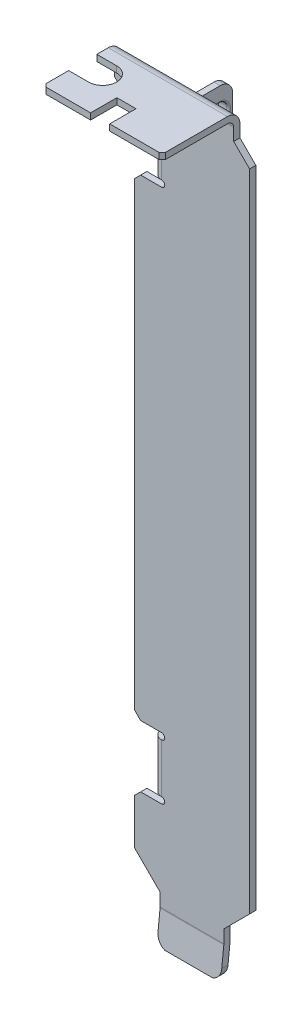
ISO-10303-21;
HEADER;
FILE_DESCRIPTION(('STEP AP214'),'2;1');
FILE_NAME('part.step','',(''),(''),'','','');
FILE_SCHEMA(('AUTOMOTIVE_DESIGN { 1 0 10303 214 1 1 1 1 }'));
ENDSEC;
DATA;
#1=APPLICATION_CONTEXT('core data for automotive mechanical design processes');
#2=APPLICATION_PROTOCOL_DEFINITION('international standard','automotive_design',2000,#1);
#3=PRODUCT_CONTEXT('',#1,'mechanical');
#4=PRODUCT('Part','Part','',(#3));
#5=PRODUCT_RELATED_PRODUCT_CATEGORY('part','',(#4));
#6=PRODUCT_DEFINITION_FORMATION('','',#4);
#7=PRODUCT_DEFINITION_CONTEXT('part definition',#1,'design');
#8=PRODUCT_DEFINITION('design','',#6,#7);
#9=PRODUCT_DEFINITION_SHAPE('','',#8);
#10=(LENGTH_UNIT() NAMED_UNIT(*) SI_UNIT(.MILLI.,.METRE.));
#11=(NAMED_UNIT(*) PLANE_ANGLE_UNIT() SI_UNIT($,.RADIAN.));
#12=(NAMED_UNIT(*) SI_UNIT($,.STERADIAN.) SOLID_ANGLE_UNIT());
#13=UNCERTAINTY_MEASURE_WITH_UNIT(LENGTH_MEASURE(1.E-05),#10,'distance_accuracy_value','');
#14=(GEOMETRIC_REPRESENTATION_CONTEXT(3) GLOBAL_UNCERTAINTY_ASSIGNED_CONTEXT((#13)) GLOBAL_UNIT_ASSIGNED_CONTEXT((#10,
#11,#12)) REPRESENTATION_CONTEXT('',''));
#15=CARTESIAN_POINT('',(0.,0.,0.));
#16=DIRECTION('',(0.,0.,1.));
#17=DIRECTION('',(1.,0.,0.));
#18=AXIS2_PLACEMENT_3D('',#15,#16,#17);
#19=CARTESIAN_POINT('',(6.03499999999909,0.,0.));
#20=DIRECTION('',(1.,0.,0.));
#21=DIRECTION('',(0.,0.,-1.));
#22=AXIS2_PLACEMENT_3D('',#19,#20,#21);
#23=PLANE('',#22);
#24=CARTESIAN_POINT('',(6.03500000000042,73.5608693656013,376.079942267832));
#25=DIRECTION('',(1.,0.,0.));
#26=DIRECTION('',(0.,0.,-1.));
#27=AXIS2_PLACEMENT_3D('',#24,#25,#26);
#28=CIRCLE('',#27,2.04999999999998);
#29=CARTESIAN_POINT('',(6.03500000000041,73.5608693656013,374.029942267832));
#30=VERTEX_POINT('',#29);
#31=EDGE_CURVE('E900',#30,#30,#28,.T.);
#32=ORIENTED_EDGE('',*,*,#31,.T.);
#33=EDGE_LOOP('',(#32));
#34=FACE_BOUND('',#33,.T.);
#35=DIRECTION('',(0.,-1.,0.));
#36=VECTOR('',#35,1.);
#37=CARTESIAN_POINT('',(6.03500000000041,0.,373.929942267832));
#38=LINE('',#37,#36);
#39=CARTESIAN_POINT('',(6.03500000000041,75.4958693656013,373.929942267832));
#40=VERTEX_POINT('',#39);
#41=CARTESIAN_POINT('',(6.03500000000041,71.6258693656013,373.929942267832));
#42=VERTEX_POINT('',#41);
#43=EDGE_CURVE('E562',#40,#42,#38,.T.);
#44=ORIENTED_EDGE('',*,*,#43,.T.);
#45=CARTESIAN_POINT('',(6.03500000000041,71.6258693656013,375.929942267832));
#46=DIRECTION('',(1.,0.,0.));
#47=DIRECTION('',(0.,0.,-1.));
#48=AXIS2_PLACEMENT_3D('',#45,#46,#47);
#49=CIRCLE('',#48,2.);
#50=CARTESIAN_POINT('',(6.03500000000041,69.6258693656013,375.929942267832));
#51=VERTEX_POINT('',#50);
#52=EDGE_CURVE('E875',#42,#51,#49,.F.);
#53=ORIENTED_EDGE('',*,*,#52,.T.);
#54=DIRECTION('',(0.,0.,1.));
#55=VECTOR('',#54,1.);
#56=CARTESIAN_POINT('',(6.03499999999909,69.6258693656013,0.));
#57=LINE('',#56,#55);
#58=CARTESIAN_POINT('',(6.03500000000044,69.6258693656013,384.289942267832));
#59=VERTEX_POINT('',#58);
#60=EDGE_CURVE('E559',#51,#59,#57,.T.);
#61=ORIENTED_EDGE('',*,*,#60,.T.);
#62=DIRECTION('',(0.,1.,0.));
#63=VECTOR('',#62,1.);
#64=CARTESIAN_POINT('',(6.03500000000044,69.6258693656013,384.289942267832));
#65=LINE('',#64,#63);
#66=CARTESIAN_POINT('',(6.03500000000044,77.4958693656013,384.289942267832));
#67=VERTEX_POINT('',#66);
#68=EDGE_CURVE('E576',#67,#59,#65,.F.);
#69=ORIENTED_EDGE('',*,*,#68,.F.);
#70=DIRECTION('',(0.,0.,-1.));
#71=VECTOR('',#70,1.);
#72=CARTESIAN_POINT('',(6.03499999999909,77.4958693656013,0.));
#73=LINE('',#72,#71);
#74=CARTESIAN_POINT('',(6.03500000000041,77.4958693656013,375.929942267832));
#75=VERTEX_POINT('',#74);
#76=EDGE_CURVE('E565',#67,#75,#73,.T.);
#77=ORIENTED_EDGE('',*,*,#76,.T.);
#78=CARTESIAN_POINT('',(6.03500000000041,75.4958693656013,375.929942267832));
#79=DIRECTION('',(1.,0.,0.));
#80=DIRECTION('',(0.,0.,-1.));
#81=AXIS2_PLACEMENT_3D('',#78,#79,#80);
#82=CIRCLE('',#81,2.);
#83=EDGE_CURVE('E873',#75,#40,#82,.F.);
#84=ORIENTED_EDGE('',*,*,#83,.T.);
#85=EDGE_LOOP('',(#44,#53,#61,#69,#77,#84));
#86=FACE_BOUND('',#85,.T.);
#87=ADVANCED_FACE('F76',(#34,#86),#23,.F.);
#88=CARTESIAN_POINT('',(6.03499999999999,0.,0.));
#89=DIRECTION('',(1.,0.,0.));
#90=DIRECTION('',(0.,0.,-1.));
#91=AXIS2_PLACEMENT_3D('',#88,#89,#90);
#92=PLANE('',#91);
#93=CARTESIAN_POINT('',(6.03500000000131,-11.8291306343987,376.079942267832));
#94=DIRECTION('',(1.,0.,0.));
#95=DIRECTION('',(0.,0.,-1.));
#96=AXIS2_PLACEMENT_3D('',#93,#94,#95);
#97=CIRCLE('',#96,2.04999999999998);
#98=CARTESIAN_POINT('',(6.0350000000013,-11.8291306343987,374.029942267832));
#99=VERTEX_POINT('',#98);
#100=EDGE_CURVE('E918',#99,#99,#97,.T.);
#101=ORIENTED_EDGE('',*,*,#100,.T.);
#102=EDGE_LOOP('',(#101));
#103=FACE_BOUND('',#102,.T.);
#104=DIRECTION('',(0.,0.,-1.));
#105=VECTOR('',#104,1.);
#106=CARTESIAN_POINT('',(6.03499999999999,-7.89413063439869,0.));
#107=LINE('',#106,#105);
#108=CARTESIAN_POINT('',(6.03500000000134,-7.89413063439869,384.289942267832));
#109=VERTEX_POINT('',#108);
#110=CARTESIAN_POINT('',(6.03500000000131,-7.89413063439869,375.929942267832));
#111=VERTEX_POINT('',#110);
#112=EDGE_CURVE('E520',#109,#111,#107,.T.);
#113=ORIENTED_EDGE('',*,*,#112,.T.);
#114=CARTESIAN_POINT('',(6.03500000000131,-9.89413063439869,375.929942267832));
#115=DIRECTION('',(1.,0.,0.));
#116=DIRECTION('',(0.,0.,-1.));
#117=AXIS2_PLACEMENT_3D('',#114,#115,#116);
#118=CIRCLE('',#117,2.);
#119=CARTESIAN_POINT('',(6.0350000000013,-9.89413063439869,373.929942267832));
#120=VERTEX_POINT('',#119);
#121=EDGE_CURVE('E856',#111,#120,#118,.F.);
#122=ORIENTED_EDGE('',*,*,#121,.T.);
#123=DIRECTION('',(0.,-1.,0.));
#124=VECTOR('',#123,1.);
#125=CARTESIAN_POINT('',(6.0350000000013,0.,373.929942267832));
#126=LINE('',#125,#124);
#127=CARTESIAN_POINT('',(6.0350000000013,-13.7641306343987,373.929942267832));
#128=VERTEX_POINT('',#127);
#129=EDGE_CURVE('E517',#120,#128,#126,.T.);
#130=ORIENTED_EDGE('',*,*,#129,.T.);
#131=CARTESIAN_POINT('',(6.03500000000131,-13.7641306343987,375.929942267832));
#132=DIRECTION('',(1.,0.,0.));
#133=DIRECTION('',(0.,0.,-1.));
#134=AXIS2_PLACEMENT_3D('',#131,#132,#133);
#135=CIRCLE('',#134,2.);
#136=CARTESIAN_POINT('',(6.03500000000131,-15.7641306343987,375.929942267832));
#137=VERTEX_POINT('',#136);
#138=EDGE_CURVE('E854',#128,#137,#135,.F.);
#139=ORIENTED_EDGE('',*,*,#138,.T.);
#140=DIRECTION('',(0.,0.,1.));
#141=VECTOR('',#140,1.);
#142=CARTESIAN_POINT('',(6.03499999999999,-15.7641306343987,0.));
#143=LINE('',#142,#141);
#144=CARTESIAN_POINT('',(6.03500000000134,-15.7641306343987,384.289942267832));
#145=VERTEX_POINT('',#144);
#146=EDGE_CURVE('E514',#137,#145,#143,.T.);
#147=ORIENTED_EDGE('',*,*,#146,.T.);
#148=DIRECTION('',(0.,1.,0.));
#149=VECTOR('',#148,1.);
#150=CARTESIAN_POINT('',(6.03500000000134,-15.7641306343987,384.289942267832));
#151=LINE('',#150,#149);
#152=EDGE_CURVE('E531',#109,#145,#151,.F.);
#153=ORIENTED_EDGE('',*,*,#152,.F.);
#154=EDGE_LOOP('',(#113,#122,#130,#139,#147,#153));
#155=FACE_BOUND('',#154,.T.);
#156=ADVANCED_FACE('F983',(#103,#155),#92,.F.);
#157=CARTESIAN_POINT('',(21.6,84.6708693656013,397.219942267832));
#158=DIRECTION('',(0.,1.,0.));
#159=DIRECTION('',(0.,0.,1.));
#160=AXIS2_PLACEMENT_3D('',#157,#158,#159);
#161=PLANE('',#160);
#162=DIRECTION('',(0.,0.,-1.));
#163=VECTOR('',#162,1.);
#164=CARTESIAN_POINT('',(0.,84.6708693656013,397.219942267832));
#165=LINE('',#164,#163);
#166=CARTESIAN_POINT('',(0.,84.6708693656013,396.719942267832));
#167=VERTEX_POINT('',#166);
#168=CARTESIAN_POINT('',(0.,84.6708693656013,393.119942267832));
#169=VERTEX_POINT('',#168);
#170=EDGE_CURVE('E758',#167,#169,#165,.T.);
#171=ORIENTED_EDGE('',*,*,#170,.F.);
#172=DIRECTION('',(-0.707106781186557,0.,-0.707106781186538));
#173=VECTOR('',#172,1.);
#174=CARTESIAN_POINT('',(11.0500000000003,84.6708693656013,407.769942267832));
#175=LINE('',#174,#173);
#176=CARTESIAN_POINT('',(0.500000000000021,84.6708693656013,397.219942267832));
#177=VERTEX_POINT('',#176);
#178=EDGE_CURVE('E884',#167,#177,#175,.F.);
#179=ORIENTED_EDGE('',*,*,#178,.T.);
#180=DIRECTION('',(-1.,0.,0.));
#181=VECTOR('',#180,1.);
#182=CARTESIAN_POINT('',(21.6,84.6708693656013,397.219942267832));
#183=LINE('',#182,#181);
#184=CARTESIAN_POINT('',(7.61,84.6708693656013,397.219942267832));
#185=VERTEX_POINT('',#184);
#186=EDGE_CURVE('E778',#185,#177,#183,.T.);
#187=ORIENTED_EDGE('',*,*,#186,.F.);
#188=DIRECTION('',(0.,0.,-1.));
#189=VECTOR('',#188,1.);
#190=CARTESIAN_POINT('',(7.61000000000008,84.6708693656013,0.));
#191=LINE('',#190,#189);
#192=CARTESIAN_POINT('',(7.61,84.6708693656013,393.019942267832));
#193=VERTEX_POINT('',#192);
#194=EDGE_CURVE('E469',#185,#193,#191,.T.);
#195=ORIENTED_EDGE('',*,*,#194,.T.);
#196=DIRECTION('',(1.,0.,0.));
#197=VECTOR('',#196,1.);
#198=CARTESIAN_POINT('',(0.,84.6708693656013,393.019942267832));
#199=LINE('',#198,#197);
#200=CARTESIAN_POINT('',(10.66,84.6708693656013,393.019942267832));
#201=VERTEX_POINT('',#200);
#202=EDGE_CURVE('E472',#193,#201,#199,.T.);
#203=ORIENTED_EDGE('',*,*,#202,.T.);
#204=DIRECTION('',(0.,0.,-1.));
#205=VECTOR('',#204,1.);
#206=CARTESIAN_POINT('',(10.66,84.6708693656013,0.));
#207=LINE('',#206,#205);
#208=CARTESIAN_POINT('',(10.66,84.6708693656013,397.219942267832));
#209=VERTEX_POINT('',#208);
#210=EDGE_CURVE('E461',#209,#201,#207,.T.);
#211=ORIENTED_EDGE('',*,*,#210,.F.);
#212=CARTESIAN_POINT('',(18.5600000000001,84.6708693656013,397.219942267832));
#213=VERTEX_POINT('',#212);
#214=EDGE_CURVE('E779',#213,#209,#183,.T.);
#215=ORIENTED_EDGE('',*,*,#214,.F.);
#216=DIRECTION('',(-0.707106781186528,0.,0.707106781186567));
#217=VECTOR('',#216,1.);
#218=CARTESIAN_POINT('',(20.08,84.6708693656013,395.699942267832));
#219=LINE('',#218,#217);
#220=CARTESIAN_POINT('',(19.0600000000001,84.6708693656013,396.719942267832));
#221=VERTEX_POINT('',#220);
#222=EDGE_CURVE('E882',#213,#221,#219,.F.);
#223=ORIENTED_EDGE('',*,*,#222,.T.);
#224=DIRECTION('',(0.,0.,-1.));
#225=VECTOR('',#224,1.);
#226=CARTESIAN_POINT('',(19.0600000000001,84.6708693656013,397.219942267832));
#227=LINE('',#226,#225);
#228=CARTESIAN_POINT('',(19.0600000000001,84.6708693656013,386.789942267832));
#229=VERTEX_POINT('',#228);
#230=EDGE_CURVE('E646',#221,#229,#227,.T.);
#231=ORIENTED_EDGE('',*,*,#230,.T.);
#232=DIRECTION('',(-1.,0.,0.));
#233=VECTOR('',#232,1.);
#234=CARTESIAN_POINT('',(21.6,84.6708693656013,386.789942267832));
#235=LINE('',#234,#233);
#236=CARTESIAN_POINT('',(0.,84.6708693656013,386.789942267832));
#237=VERTEX_POINT('',#236);
#238=EDGE_CURVE('E781',#229,#237,#235,.T.);
#239=ORIENTED_EDGE('',*,*,#238,.T.);
#240=CARTESIAN_POINT('',(0.,84.6708693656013,388.619942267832));
#241=VERTEX_POINT('',#240);
#242=EDGE_CURVE('E757',#241,#237,#165,.T.);
#243=ORIENTED_EDGE('',*,*,#242,.F.);
#244=DIRECTION('',(-1.,0.,0.));
#245=VECTOR('',#244,1.);
#246=CARTESIAN_POINT('',(0.,84.6708693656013,388.619942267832));
#247=LINE('',#246,#245);
#248=CARTESIAN_POINT('',(3.18,84.6708693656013,388.619942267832));
#249=VERTEX_POINT('',#248);
#250=EDGE_CURVE('E491',#249,#241,#247,.T.);
#251=ORIENTED_EDGE('',*,*,#250,.F.);
#252=CARTESIAN_POINT('',(3.18,84.6708693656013,390.869942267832));
#253=DIRECTION('',(0.,1.,0.));
#254=DIRECTION('',(0.,0.,1.));
#255=AXIS2_PLACEMENT_3D('',#252,#253,#254);
#256=CIRCLE('',#255,2.24999999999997);
#257=CARTESIAN_POINT('',(3.18,84.6708693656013,393.119942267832));
#258=VERTEX_POINT('',#257);
#259=EDGE_CURVE('E500',#258,#249,#256,.T.);
#260=ORIENTED_EDGE('',*,*,#259,.F.);
#261=DIRECTION('',(-1.,0.,0.));
#262=VECTOR('',#261,1.);
#263=CARTESIAN_POINT('',(0.,84.6708693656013,393.119942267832));
#264=LINE('',#263,#262);
#265=EDGE_CURVE('E484',#258,#169,#264,.T.);
#266=ORIENTED_EDGE('',*,*,#265,.T.);
#267=EDGE_LOOP('',(#171,#179,#187,#195,#203,#211,#215,#223,#231,#239,#243,#251,#260,#266));
#268=FACE_BOUND('',#267,.T.);
#269=ADVANCED_FACE('F1011',(#268),#161,.T.);
#270=CARTESIAN_POINT('',(21.6,83.6708693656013,397.219942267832));
#271=DIRECTION('',(0.,1.,0.));
#272=DIRECTION('',(0.,0.,1.));
#273=AXIS2_PLACEMENT_3D('',#270,#271,#272);
#274=PLANE('',#273);
#275=DIRECTION('',(-1.,0.,0.));
#276=VECTOR('',#275,1.);
#277=CARTESIAN_POINT('',(21.6,83.6708693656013,397.219942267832));
#278=LINE('',#277,#276);
#279=CARTESIAN_POINT('',(7.61,83.6708693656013,397.219942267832));
#280=VERTEX_POINT('',#279);
#281=CARTESIAN_POINT('',(0.500000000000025,83.6708693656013,397.219942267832));
#282=VERTEX_POINT('',#281);
#283=EDGE_CURVE('E776',#280,#282,#278,.T.);
#284=ORIENTED_EDGE('',*,*,#283,.T.);
#285=DIRECTION('',(0.707106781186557,0.,0.707106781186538));
#286=VECTOR('',#285,1.);
#287=CARTESIAN_POINT('',(0.,83.6708693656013,396.719942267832));
#288=LINE('',#287,#286);
#289=CARTESIAN_POINT('',(0.,83.6708693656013,396.719942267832));
#290=VERTEX_POINT('',#289);
#291=EDGE_CURVE('E890',#282,#290,#288,.F.);
#292=ORIENTED_EDGE('',*,*,#291,.T.);
#293=DIRECTION('',(0.,0.,-1.));
#294=VECTOR('',#293,1.);
#295=CARTESIAN_POINT('',(0.,83.6708693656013,397.219942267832));
#296=LINE('',#295,#294);
#297=CARTESIAN_POINT('',(0.,83.6708693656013,393.119942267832));
#298=VERTEX_POINT('',#297);
#299=EDGE_CURVE('E761',#290,#298,#296,.T.);
#300=ORIENTED_EDGE('',*,*,#299,.T.);
#301=DIRECTION('',(-1.,0.,0.));
#302=VECTOR('',#301,1.);
#303=CARTESIAN_POINT('',(0.,83.6708693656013,393.119942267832));
#304=LINE('',#303,#302);
#305=CARTESIAN_POINT('',(3.18,83.6708693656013,393.119942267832));
#306=VERTEX_POINT('',#305);
#307=EDGE_CURVE('E487',#306,#298,#304,.T.);
#308=ORIENTED_EDGE('',*,*,#307,.F.);
#309=CARTESIAN_POINT('',(3.18,83.6708693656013,390.869942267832));
#310=DIRECTION('',(0.,1.,0.));
#311=DIRECTION('',(0.,0.,1.));
#312=AXIS2_PLACEMENT_3D('',#309,#310,#311);
#313=CIRCLE('',#312,2.24999999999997);
#314=CARTESIAN_POINT('',(3.18,83.6708693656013,388.619942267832));
#315=VERTEX_POINT('',#314);
#316=EDGE_CURVE('E490',#306,#315,#313,.T.);
#317=ORIENTED_EDGE('',*,*,#316,.T.);
#318=DIRECTION('',(-1.,0.,0.));
#319=VECTOR('',#318,1.);
#320=CARTESIAN_POINT('',(0.,83.6708693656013,388.619942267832));
#321=LINE('',#320,#319);
#322=CARTESIAN_POINT('',(0.,83.6708693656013,388.619942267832));
#323=VERTEX_POINT('',#322);
#324=EDGE_CURVE('E494',#315,#323,#321,.T.);
#325=ORIENTED_EDGE('',*,*,#324,.T.);
#326=CARTESIAN_POINT('',(0.,83.6708693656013,386.789942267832));
#327=VERTEX_POINT('',#326);
#328=EDGE_CURVE('E760',#323,#327,#296,.T.);
#329=ORIENTED_EDGE('',*,*,#328,.T.);
#330=DIRECTION('',(-1.,0.,0.));
#331=VECTOR('',#330,1.);
#332=CARTESIAN_POINT('',(21.6,83.6708693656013,386.789942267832));
#333=LINE('',#332,#331);
#334=CARTESIAN_POINT('',(19.0600000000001,83.6708693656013,386.789942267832));
#335=VERTEX_POINT('',#334);
#336=EDGE_CURVE('E773',#335,#327,#333,.T.);
#337=ORIENTED_EDGE('',*,*,#336,.F.);
#338=DIRECTION('',(0.,0.,-1.));
#339=VECTOR('',#338,1.);
#340=CARTESIAN_POINT('',(19.0600000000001,83.6708693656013,397.219942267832));
#341=LINE('',#340,#339);
#342=CARTESIAN_POINT('',(19.0600000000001,83.6708693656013,396.719942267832));
#343=VERTEX_POINT('',#342);
#344=EDGE_CURVE('E642',#343,#335,#341,.T.);
#345=ORIENTED_EDGE('',*,*,#344,.F.);
#346=DIRECTION('',(0.707106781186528,0.,-0.707106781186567));
#347=VECTOR('',#346,1.);
#348=CARTESIAN_POINT('',(18.5600000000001,83.6708693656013,397.219942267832));
#349=LINE('',#348,#347);
#350=CARTESIAN_POINT('',(18.5600000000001,83.6708693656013,397.219942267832));
#351=VERTEX_POINT('',#350);
#352=EDGE_CURVE('E888',#343,#351,#349,.F.);
#353=ORIENTED_EDGE('',*,*,#352,.T.);
#354=CARTESIAN_POINT('',(10.66,83.6708693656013,397.219942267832));
#355=VERTEX_POINT('',#354);
#356=EDGE_CURVE('E468',#351,#355,#278,.T.);
#357=ORIENTED_EDGE('',*,*,#356,.T.);
#358=DIRECTION('',(0.,0.,-1.));
#359=VECTOR('',#358,1.);
#360=CARTESIAN_POINT('',(10.66,83.6708693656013,0.));
#361=LINE('',#360,#359);
#362=CARTESIAN_POINT('',(10.66,83.6708693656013,393.019942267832));
#363=VERTEX_POINT('',#362);
#364=EDGE_CURVE('E453',#355,#363,#361,.T.);
#365=ORIENTED_EDGE('',*,*,#364,.T.);
#366=DIRECTION('',(1.,0.,0.));
#367=VECTOR('',#366,1.);
#368=CARTESIAN_POINT('',(0.,83.6708693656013,393.019942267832));
#369=LINE('',#368,#367);
#370=CARTESIAN_POINT('',(7.61,83.6708693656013,393.019942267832));
#371=VERTEX_POINT('',#370);
#372=EDGE_CURVE('E442',#371,#363,#369,.T.);
#373=ORIENTED_EDGE('',*,*,#372,.F.);
#374=DIRECTION('',(0.,0.,-1.));
#375=VECTOR('',#374,1.);
#376=CARTESIAN_POINT('',(7.61000000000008,83.6708693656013,0.));
#377=LINE('',#376,#375);
#378=EDGE_CURVE('E452',#280,#371,#377,.T.);
#379=ORIENTED_EDGE('',*,*,#378,.F.);
#380=EDGE_LOOP('',(#284,#292,#300,#308,#317,#325,#329,#337,#345,#353,#357,#365,#373,#379));
#381=FACE_BOUND('',#380,.T.);
#382=ADVANCED_FACE('F466',(#381),#274,.F.);
#383=CARTESIAN_POINT('',(21.6,83.6708693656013,397.219942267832));
#384=DIRECTION('',(0.,0.,1.));
#385=DIRECTION('',(1.,0.,0.));
#386=AXIS2_PLACEMENT_3D('',#383,#384,#385);
#387=PLANE('',#386);
#388=ORIENTED_EDGE('',*,*,#186,.T.);
#389=DIRECTION('',(0.,-1.,0.));
#390=VECTOR('',#389,1.);
#391=CARTESIAN_POINT('',(0.500000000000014,83.6708693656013,397.219942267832));
#392=LINE('',#391,#390);
#393=EDGE_CURVE('E886',#177,#282,#392,.T.);
#394=ORIENTED_EDGE('',*,*,#393,.T.);
#395=ORIENTED_EDGE('',*,*,#283,.F.);
#396=DIRECTION('',(0.,1.,0.));
#397=VECTOR('',#396,1.);
#398=CARTESIAN_POINT('',(7.61,83.6708693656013,397.219942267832));
#399=LINE('',#398,#397);
#400=EDGE_CURVE('E481',#280,#185,#399,.T.);
#401=ORIENTED_EDGE('',*,*,#400,.T.);
#402=EDGE_LOOP('',(#388,#394,#395,#401));
#403=FACE_BOUND('',#402,.T.);
#404=ADVANCED_FACE('F1139',(#403),#387,.T.);
#405=CARTESIAN_POINT('',(0.,82.6708693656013,385.789942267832));
#406=DIRECTION('',(-1.,0.,0.));
#407=DIRECTION('',(0.,0.,1.));
#408=AXIS2_PLACEMENT_3D('',#405,#406,#407);
#409=PLANE('',#408);
#410=ORIENTED_EDGE('',*,*,#299,.F.);
#411=DIRECTION('',(0.,1.,0.));
#412=VECTOR('',#411,1.);
#413=CARTESIAN_POINT('',(0.,82.6708693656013,396.719942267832));
#414=LINE('',#413,#412);
#415=EDGE_CURVE('E879',#290,#167,#414,.T.);
#416=ORIENTED_EDGE('',*,*,#415,.T.);
#417=ORIENTED_EDGE('',*,*,#170,.T.);
#418=DIRECTION('',(0.,1.,0.));
#419=VECTOR('',#418,1.);
#420=CARTESIAN_POINT('',(0.,83.6708693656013,393.119942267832));
#421=LINE('',#420,#419);
#422=EDGE_CURVE('E504',#298,#169,#421,.T.);
#423=ORIENTED_EDGE('',*,*,#422,.F.);
#424=EDGE_LOOP('',(#410,#416,#417,#423));
#425=FACE_BOUND('',#424,.T.);
#426=ADVANCED_FACE('F1152',(#425),#409,.T.);
#427=CARTESIAN_POINT('',(21.6,82.6708693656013,384.789942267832));
#428=DIRECTION('',(0.,0.,-1.));
#429=DIRECTION('',(-1.,0.,0.));
#430=AXIS2_PLACEMENT_3D('',#427,#428,#429);
#431=PLANE('',#430);
#432=DIRECTION('',(-1.,0.,0.));
#433=VECTOR('',#432,1.);
#434=CARTESIAN_POINT('',(0.,-6.89413063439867,384.789942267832));
#435=LINE('',#434,#433);
#436=CARTESIAN_POINT('',(7.53500000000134,-6.89413063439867,384.789942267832));
#437=VERTEX_POINT('',#436);
#438=CARTESIAN_POINT('',(4.18000000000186,-6.89413063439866,384.789942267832));
#439=VERTEX_POINT('',#438);
#440=EDGE_CURVE('E668',#437,#439,#435,.T.);
#441=ORIENTED_EDGE('',*,*,#440,.T.);
#442=DIRECTION('',(0.707106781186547,-0.707106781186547,0.));
#443=VECTOR('',#442,1.);
#444=CARTESIAN_POINT('',(-31.8924999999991,29.1783693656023,384.789942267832));
#445=LINE('',#444,#443);
#446=CARTESIAN_POINT('',(3.18000000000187,-5.89413063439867,384.789942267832));
#447=VERTEX_POINT('',#446);
#448=EDGE_CURVE('E937',#439,#447,#445,.F.);
#449=ORIENTED_EDGE('',*,*,#448,.T.);
#450=DIRECTION('',(0.,1.,0.));
#451=VECTOR('',#450,1.);
#452=CARTESIAN_POINT('',(3.18000000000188,0.,384.789942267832));
#453=LINE('',#452,#451);
#454=CARTESIAN_POINT('',(3.18000000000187,67.6258693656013,384.789942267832));
#455=VERTEX_POINT('',#454);
#456=EDGE_CURVE('E671',#447,#455,#453,.T.);
#457=ORIENTED_EDGE('',*,*,#456,.T.);
#458=DIRECTION('',(0.707106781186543,0.707106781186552,0.));
#459=VECTOR('',#458,1.);
#460=CARTESIAN_POINT('',(19.9125000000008,84.3583693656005,384.789942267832));
#461=LINE('',#460,#459);
#462=CARTESIAN_POINT('',(4.18000000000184,68.6258693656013,384.789942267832));
#463=VERTEX_POINT('',#462);
#464=EDGE_CURVE('E934',#455,#463,#461,.T.);
#465=ORIENTED_EDGE('',*,*,#464,.T.);
#466=DIRECTION('',(-1.,0.,0.));
#467=VECTOR('',#466,1.);
#468=CARTESIAN_POINT('',(-6.34916835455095E-13,68.6258693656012,384.789942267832));
#469=LINE('',#468,#467);
#470=CARTESIAN_POINT('',(7.5350000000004,68.6258693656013,384.789942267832));
#471=VERTEX_POINT('',#470);
#472=EDGE_CURVE('E674',#471,#463,#469,.T.);
#473=ORIENTED_EDGE('',*,*,#472,.F.);
#474=CARTESIAN_POINT('',(7.53500000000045,69.1258693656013,384.789942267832));
#475=DIRECTION('',(0.,0.,1.));
#476=DIRECTION('',(1.,0.,0.));
#477=AXIS2_PLACEMENT_3D('',#474,#475,#476);
#478=CIRCLE('',#477,0.5);
#479=CARTESIAN_POINT('',(7.5350000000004,69.6258693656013,384.789942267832));
#480=VERTEX_POINT('',#479);
#481=EDGE_CURVE('E677',#471,#480,#478,.T.);
#482=ORIENTED_EDGE('',*,*,#481,.T.);
#483=DIRECTION('',(0.,1.,0.));
#484=VECTOR('',#483,1.);
#485=CARTESIAN_POINT('',(7.53500000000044,77.4958693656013,384.789942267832));
#486=LINE('',#485,#484);
#487=CARTESIAN_POINT('',(7.53500000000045,77.4958693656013,384.789942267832));
#488=VERTEX_POINT('',#487);
#489=EDGE_CURVE('E599',#488,#480,#486,.F.);
#490=ORIENTED_EDGE('',*,*,#489,.F.);
#491=CARTESIAN_POINT('',(7.53500000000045,77.9958693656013,384.789942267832));
#492=DIRECTION('',(0.,0.,1.));
#493=DIRECTION('',(1.,0.,0.));
#494=AXIS2_PLACEMENT_3D('',#491,#492,#493);
#495=CIRCLE('',#494,0.5);
#496=CARTESIAN_POINT('',(7.53500000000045,78.4958693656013,384.789942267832));
#497=VERTEX_POINT('',#496);
#498=EDGE_CURVE('E680',#488,#497,#495,.T.);
#499=ORIENTED_EDGE('',*,*,#498,.T.);
#500=DIRECTION('',(-1.,0.,0.));
#501=VECTOR('',#500,1.);
#502=CARTESIAN_POINT('',(0.,78.4958693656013,384.789942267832));
#503=LINE('',#502,#501);
#504=CARTESIAN_POINT('',(1.66000000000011,78.4958693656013,384.789942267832));
#505=VERTEX_POINT('',#504);
#506=EDGE_CURVE('E683',#497,#505,#503,.T.);
#507=ORIENTED_EDGE('',*,*,#506,.T.);
#508=DIRECTION('',(0.707106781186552,-0.707106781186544,0.));
#509=VECTOR('',#508,1.);
#510=CARTESIAN_POINT('',(40.0779346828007,40.0779346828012,384.789942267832));
#511=LINE('',#510,#509);
#512=CARTESIAN_POINT('',(0.,80.1558693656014,384.789942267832));
#513=VERTEX_POINT('',#512);
#514=EDGE_CURVE('E686',#513,#505,#511,.T.);
#515=ORIENTED_EDGE('',*,*,#514,.F.);
#516=DIRECTION('',(0.,-1.,0.));
#517=VECTOR('',#516,1.);
#518=CARTESIAN_POINT('',(0.,82.6708693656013,384.789942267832));
#519=LINE('',#518,#517);
#520=CARTESIAN_POINT('',(0.,82.6708693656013,384.789942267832));
#521=VERTEX_POINT('',#520);
#522=EDGE_CURVE('E743',#521,#513,#519,.T.);
#523=ORIENTED_EDGE('',*,*,#522,.F.);
#524=DIRECTION('',(-1.,0.,0.));
#525=VECTOR('',#524,1.);
#526=CARTESIAN_POINT('',(21.6,82.6708693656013,384.789942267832));
#527=LINE('',#526,#525);
#528=CARTESIAN_POINT('',(19.0600000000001,82.6708693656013,384.789942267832));
#529=VERTEX_POINT('',#528);
#530=EDGE_CURVE('E784',#529,#521,#527,.T.);
#531=ORIENTED_EDGE('',*,*,#530,.F.);
#532=DIRECTION('',(0.,1.,0.));
#533=VECTOR('',#532,1.);
#534=CARTESIAN_POINT('',(19.0600000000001,80.7211564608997,384.789942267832));
#535=LINE('',#534,#533);
#536=CARTESIAN_POINT('',(19.0600000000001,80.7211564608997,384.789942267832));
#537=VERTEX_POINT('',#536);
#538=EDGE_CURVE('E640',#537,#529,#535,.T.);
#539=ORIENTED_EDGE('',*,*,#538,.F.);
#540=DIRECTION('',(-0.707106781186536,0.707106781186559,0.));
#541=VECTOR('',#540,1.);
#542=CARTESIAN_POINT('',(21.6,78.1811564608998,384.789942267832));
#543=LINE('',#542,#541);
#544=CARTESIAN_POINT('',(21.6,78.1811564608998,384.789942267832));
#545=VERTEX_POINT('',#544);
#546=EDGE_CURVE('E638',#545,#537,#543,.T.);
#547=ORIENTED_EDGE('',*,*,#546,.F.);
#548=DIRECTION('',(0.,-1.,0.));
#549=VECTOR('',#548,1.);
#550=CARTESIAN_POINT('',(21.6,82.6708693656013,384.789942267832));
#551=LINE('',#550,#549);
#552=CARTESIAN_POINT('',(21.6,-24.9688435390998,384.789942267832));
#553=VERTEX_POINT('',#552);
#554=EDGE_CURVE('E744',#545,#553,#551,.T.);
#555=ORIENTED_EDGE('',*,*,#554,.T.);
#556=DIRECTION('',(0.707106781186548,0.707106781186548,0.));
#557=VECTOR('',#556,1.);
#558=CARTESIAN_POINT('',(17.4800000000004,-29.0888435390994,384.789942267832));
#559=LINE('',#558,#557);
#560=CARTESIAN_POINT('',(17.4800000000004,-29.0888435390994,384.789942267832));
#561=VERTEX_POINT('',#560);
#562=EDGE_CURVE('E613',#561,#553,#559,.T.);
#563=ORIENTED_EDGE('',*,*,#562,.F.);
#564=DIRECTION('',(0.,1.,0.));
#565=VECTOR('',#564,1.);
#566=CARTESIAN_POINT('',(17.4800000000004,-34.4488435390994,384.789942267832));
#567=LINE('',#566,#565);
#568=CARTESIAN_POINT('',(17.4800000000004,-31.1643150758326,384.789942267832));
#569=VERTEX_POINT('',#568);
#570=EDGE_CURVE('E606',#569,#561,#567,.T.);
#571=ORIENTED_EDGE('',*,*,#570,.F.);
#572=DIRECTION('',(-1.,0.,0.));
#573=VECTOR('',#572,1.);
#574=CARTESIAN_POINT('',(21.6,-31.1643150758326,384.789942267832));
#575=LINE('',#574,#573);
#576=CARTESIAN_POINT('',(7.29000000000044,-31.1643150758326,384.789942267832));
#577=VERTEX_POINT('',#576);
#578=EDGE_CURVE('E786',#569,#577,#575,.T.);
#579=ORIENTED_EDGE('',*,*,#578,.T.);
#580=DIRECTION('',(0.,-1.,0.));
#581=VECTOR('',#580,1.);
#582=CARTESIAN_POINT('',(7.29000000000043,0.,384.789942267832));
#583=LINE('',#582,#581);
#584=CARTESIAN_POINT('',(7.29000000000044,-29.0888435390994,384.789942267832));
#585=VERTEX_POINT('',#584);
#586=EDGE_CURVE('E653',#585,#577,#583,.T.);
#587=ORIENTED_EDGE('',*,*,#586,.F.);
#588=DIRECTION('',(0.707106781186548,-0.707106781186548,0.));
#589=VECTOR('',#588,1.);
#590=CARTESIAN_POINT('',(-10.8994217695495,-10.8994217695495,384.789942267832));
#591=LINE('',#590,#589);
#592=CARTESIAN_POINT('',(3.18000000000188,-24.9788435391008,384.789942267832));
#593=VERTEX_POINT('',#592);
#594=EDGE_CURVE('E656',#593,#585,#591,.T.);
#595=ORIENTED_EDGE('',*,*,#594,.F.);
#596=DIRECTION('',(0.,1.,0.));
#597=VECTOR('',#596,1.);
#598=CARTESIAN_POINT('',(3.18000000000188,0.,384.789942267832));
#599=LINE('',#598,#597);
#600=CARTESIAN_POINT('',(3.18000000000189,-17.7641306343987,384.789942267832));
#601=VERTEX_POINT('',#600);
#602=EDGE_CURVE('E658',#593,#601,#599,.T.);
#603=ORIENTED_EDGE('',*,*,#602,.T.);
#604=DIRECTION('',(-0.707106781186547,-0.707106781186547,0.));
#605=VECTOR('',#604,1.);
#606=CARTESIAN_POINT('',(62.607500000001,41.6633693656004,384.789942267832));
#607=LINE('',#606,#605);
#608=CARTESIAN_POINT('',(4.18000000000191,-16.7641306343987,384.789942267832));
#609=VERTEX_POINT('',#608);
#610=EDGE_CURVE('E91',#601,#609,#607,.F.);
#611=ORIENTED_EDGE('',*,*,#610,.T.);
#612=DIRECTION('',(1.,0.,0.));
#613=VECTOR('',#612,1.);
#614=CARTESIAN_POINT('',(0.,-16.7641306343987,384.789942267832));
#615=LINE('',#614,#613);
#616=CARTESIAN_POINT('',(7.53500000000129,-16.7641306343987,384.789942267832));
#617=VERTEX_POINT('',#616);
#618=EDGE_CURVE('E660',#609,#617,#615,.T.);
#619=ORIENTED_EDGE('',*,*,#618,.T.);
#620=CARTESIAN_POINT('',(7.53500000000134,-16.2641306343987,384.789942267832));
#621=DIRECTION('',(0.,0.,1.));
#622=DIRECTION('',(1.,0.,0.));
#623=AXIS2_PLACEMENT_3D('',#620,#621,#622);
#624=CIRCLE('',#623,0.5);
#625=CARTESIAN_POINT('',(7.53500000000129,-15.7641306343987,384.789942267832));
#626=VERTEX_POINT('',#625);
#627=EDGE_CURVE('E662',#617,#626,#624,.T.);
#628=ORIENTED_EDGE('',*,*,#627,.T.);
#629=DIRECTION('',(0.,1.,0.));
#630=VECTOR('',#629,1.);
#631=CARTESIAN_POINT('',(7.53500000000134,-7.89413063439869,384.789942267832));
#632=LINE('',#631,#630);
#633=CARTESIAN_POINT('',(7.53500000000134,-7.89413063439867,384.789942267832));
#634=VERTEX_POINT('',#633);
#635=EDGE_CURVE('E554',#634,#626,#632,.F.);
#636=ORIENTED_EDGE('',*,*,#635,.F.);
#637=CARTESIAN_POINT('',(7.53500000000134,-7.39413063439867,384.789942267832));
#638=DIRECTION('',(0.,0.,1.));
#639=DIRECTION('',(1.,0.,0.));
#640=AXIS2_PLACEMENT_3D('',#637,#638,#639);
#641=CIRCLE('',#640,0.5);
#642=EDGE_CURVE('E665',#634,#437,#641,.T.);
#643=ORIENTED_EDGE('',*,*,#642,.T.);
#644=EDGE_LOOP('',(#441,#449,#457,#465,#473,#482,#490,#499,#507,#515,#523,#531,#539,#547,#555,
#563,#571,#579,#587,#595,#603,#611,#619,#628,#636,#643));
#645=FACE_BOUND('',#644,.T.);
#646=ADVANCED_FACE('F952',(#645),#431,.T.);
#647=CARTESIAN_POINT('',(21.6,82.6708693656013,385.789942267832));
#648=DIRECTION('',(0.,0.,-1.));
#649=DIRECTION('',(-1.,0.,0.));
#650=AXIS2_PLACEMENT_3D('',#647,#648,#649);
#651=PLANE('',#650);
#652=DIRECTION('',(0.,-1.,0.));
#653=VECTOR('',#652,1.);
#654=CARTESIAN_POINT('',(3.18000000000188,82.6708693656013,385.789942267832));
#655=LINE('',#654,#653);
#656=CARTESIAN_POINT('',(3.18000000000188,67.6258693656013,385.789942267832));
#657=VERTEX_POINT('',#656);
#658=CARTESIAN_POINT('',(3.18000000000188,-5.89413063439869,385.789942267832));
#659=VERTEX_POINT('',#658);
#660=EDGE_CURVE('E818',#657,#659,#655,.T.);
#661=ORIENTED_EDGE('',*,*,#660,.T.);
#662=DIRECTION('',(-0.707106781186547,0.707106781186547,0.));
#663=VECTOR('',#662,1.);
#664=CARTESIAN_POINT('',(3.18000000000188,-5.89413063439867,385.789942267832));
#665=LINE('',#664,#663);
#666=CARTESIAN_POINT('',(4.18000000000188,-6.89413063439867,385.789942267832));
#667=VERTEX_POINT('',#666);
#668=EDGE_CURVE('E930',#659,#667,#665,.F.);
#669=ORIENTED_EDGE('',*,*,#668,.T.);
#670=DIRECTION('',(1.,0.,0.));
#671=VECTOR('',#670,1.);
#672=CARTESIAN_POINT('',(21.6,-6.89413063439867,385.789942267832));
#673=LINE('',#672,#671);
#674=CARTESIAN_POINT('',(7.53500000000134,-6.89413063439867,385.789942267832));
#675=VERTEX_POINT('',#674);
#676=EDGE_CURVE('E816',#667,#675,#673,.T.);
#677=ORIENTED_EDGE('',*,*,#676,.T.);
#678=CARTESIAN_POINT('',(7.53500000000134,-7.39413063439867,385.789942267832));
#679=DIRECTION('',(0.,0.,-1.));
#680=DIRECTION('',(-1.,0.,0.));
#681=AXIS2_PLACEMENT_3D('',#678,#679,#680);
#682=CIRCLE('',#681,0.5);
#683=CARTESIAN_POINT('',(7.53500000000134,-7.89413063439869,385.789942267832));
#684=VERTEX_POINT('',#683);
#685=EDGE_CURVE('E814',#675,#684,#682,.T.);
#686=ORIENTED_EDGE('',*,*,#685,.T.);
#687=DIRECTION('',(0.,1.,0.));
#688=VECTOR('',#687,1.);
#689=CARTESIAN_POINT('',(7.53500000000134,-7.89413063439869,385.789942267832));
#690=LINE('',#689,#688);
#691=CARTESIAN_POINT('',(7.53500000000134,-15.7641306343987,385.789942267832));
#692=VERTEX_POINT('',#691);
#693=EDGE_CURVE('E541',#684,#692,#690,.F.);
#694=ORIENTED_EDGE('',*,*,#693,.T.);
#695=CARTESIAN_POINT('',(7.53500000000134,-16.2641306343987,385.789942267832));
#696=DIRECTION('',(0.,0.,-1.));
#697=DIRECTION('',(-1.,0.,0.));
#698=AXIS2_PLACEMENT_3D('',#695,#696,#697);
#699=CIRCLE('',#698,0.5);
#700=CARTESIAN_POINT('',(7.53500000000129,-16.7641306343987,385.789942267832));
#701=VERTEX_POINT('',#700);
#702=EDGE_CURVE('E811',#692,#701,#699,.T.);
#703=ORIENTED_EDGE('',*,*,#702,.T.);
#704=DIRECTION('',(-1.,0.,0.));
#705=VECTOR('',#704,1.);
#706=CARTESIAN_POINT('',(21.6,-16.7641306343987,385.789942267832));
#707=LINE('',#706,#705);
#708=CARTESIAN_POINT('',(4.18000000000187,-16.7641306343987,385.789942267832));
#709=VERTEX_POINT('',#708);
#710=EDGE_CURVE('E808',#701,#709,#707,.T.);
#711=ORIENTED_EDGE('',*,*,#710,.T.);
#712=DIRECTION('',(0.707106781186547,0.707106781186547,0.));
#713=VECTOR('',#712,1.);
#714=CARTESIAN_POINT('',(4.18000000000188,-16.7641306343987,385.789942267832));
#715=LINE('',#714,#713);
#716=CARTESIAN_POINT('',(3.18000000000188,-17.7641306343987,385.789942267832));
#717=VERTEX_POINT('',#716);
#718=EDGE_CURVE('E928',#709,#717,#715,.F.);
#719=ORIENTED_EDGE('',*,*,#718,.T.);
#720=DIRECTION('',(0.,-1.,0.));
#721=VECTOR('',#720,1.);
#722=CARTESIAN_POINT('',(3.18000000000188,82.6708693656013,385.789942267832));
#723=LINE('',#722,#721);
#724=CARTESIAN_POINT('',(3.18000000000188,-24.9788435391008,385.789942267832));
#725=VERTEX_POINT('',#724);
#726=EDGE_CURVE('E806',#717,#725,#723,.T.);
#727=ORIENTED_EDGE('',*,*,#726,.T.);
#728=DIRECTION('',(-0.707106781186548,0.707106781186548,0.));
#729=VECTOR('',#728,1.);
#730=CARTESIAN_POINT('',(-41.4348564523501,19.6360129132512,385.789942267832));
#731=LINE('',#730,#729);
#732=CARTESIAN_POINT('',(7.29000000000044,-29.0888435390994,385.789942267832));
#733=VERTEX_POINT('',#732);
#734=EDGE_CURVE('E803',#733,#725,#731,.T.);
#735=ORIENTED_EDGE('',*,*,#734,.F.);
#736=DIRECTION('',(0.,1.,0.));
#737=VECTOR('',#736,1.);
#738=CARTESIAN_POINT('',(7.29000000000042,82.6708693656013,385.789942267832));
#739=LINE('',#738,#737);
#740=CARTESIAN_POINT('',(7.29000000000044,-31.1643150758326,385.789942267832));
#741=VERTEX_POINT('',#740);
#742=EDGE_CURVE('E692',#741,#733,#739,.T.);
#743=ORIENTED_EDGE('',*,*,#742,.F.);
#744=DIRECTION('',(-1.,0.,0.));
#745=VECTOR('',#744,1.);
#746=CARTESIAN_POINT('',(21.6,-31.1643150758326,385.789942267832));
#747=LINE('',#746,#745);
#748=CARTESIAN_POINT('',(17.4800000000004,-31.1643150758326,385.789942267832));
#749=VERTEX_POINT('',#748);
#750=EDGE_CURVE('E769',#749,#741,#747,.T.);
#751=ORIENTED_EDGE('',*,*,#750,.F.);
#752=DIRECTION('',(0.,-1.,0.));
#753=VECTOR('',#752,1.);
#754=CARTESIAN_POINT('',(17.4800000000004,82.6708693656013,385.789942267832));
#755=LINE('',#754,#753);
#756=CARTESIAN_POINT('',(17.4800000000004,-29.0888435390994,385.789942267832));
#757=VERTEX_POINT('',#756);
#758=EDGE_CURVE('E617',#757,#749,#755,.T.);
#759=ORIENTED_EDGE('',*,*,#758,.F.);
#760=DIRECTION('',(-0.707106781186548,-0.707106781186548,0.));
#761=VECTOR('',#760,1.);
#762=CARTESIAN_POINT('',(75.4198564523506,28.8510129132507,385.789942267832));
#763=LINE('',#762,#761);
#764=CARTESIAN_POINT('',(21.6,-24.9688435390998,385.789942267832));
#765=VERTEX_POINT('',#764);
#766=EDGE_CURVE('E630',#765,#757,#763,.T.);
#767=ORIENTED_EDGE('',*,*,#766,.F.);
#768=DIRECTION('',(0.,1.,0.));
#769=VECTOR('',#768,1.);
#770=CARTESIAN_POINT('',(21.6,82.6708693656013,385.789942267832));
#771=LINE('',#770,#769);
#772=CARTESIAN_POINT('',(21.6,78.1811564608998,385.789942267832));
#773=VERTEX_POINT('',#772);
#774=EDGE_CURVE('E747',#773,#765,#771,.F.);
#775=ORIENTED_EDGE('',*,*,#774,.F.);
#776=DIRECTION('',(0.707106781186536,-0.707106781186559,0.));
#777=VECTOR('',#776,1.);
#778=CARTESIAN_POINT('',(19.3551435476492,80.4260129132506,385.789942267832));
#779=LINE('',#778,#777);
#780=CARTESIAN_POINT('',(19.0600000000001,80.7211564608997,385.789942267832));
#781=VERTEX_POINT('',#780);
#782=EDGE_CURVE('E651',#781,#773,#779,.T.);
#783=ORIENTED_EDGE('',*,*,#782,.F.);
#784=DIRECTION('',(0.,-1.,0.));
#785=VECTOR('',#784,1.);
#786=CARTESIAN_POINT('',(19.0600000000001,82.6708693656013,385.789942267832));
#787=LINE('',#786,#785);
#788=CARTESIAN_POINT('',(19.0600000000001,82.6708693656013,385.789942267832));
#789=VERTEX_POINT('',#788);
#790=EDGE_CURVE('E644',#789,#781,#787,.T.);
#791=ORIENTED_EDGE('',*,*,#790,.F.);
#792=DIRECTION('',(-1.,0.,0.));
#793=VECTOR('',#792,1.);
#794=CARTESIAN_POINT('',(21.6,82.6708693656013,385.789942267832));
#795=LINE('',#794,#793);
#796=CARTESIAN_POINT('',(0.,82.6708693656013,385.789942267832));
#797=VERTEX_POINT('',#796);
#798=EDGE_CURVE('E771',#789,#797,#795,.T.);
#799=ORIENTED_EDGE('',*,*,#798,.T.);
#800=DIRECTION('',(0.,1.,0.));
#801=VECTOR('',#800,1.);
#802=CARTESIAN_POINT('',(0.,82.6708693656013,385.789942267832));
#803=LINE('',#802,#801);
#804=CARTESIAN_POINT('',(0.,80.1558693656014,385.789942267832));
#805=VERTEX_POINT('',#804);
#806=EDGE_CURVE('E748',#797,#805,#803,.F.);
#807=ORIENTED_EDGE('',*,*,#806,.T.);
#808=DIRECTION('',(-0.707106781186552,0.707106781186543,0.));
#809=VECTOR('',#808,1.);
#810=CARTESIAN_POINT('',(9.54250000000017,70.6133693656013,385.789942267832));
#811=LINE('',#810,#809);
#812=CARTESIAN_POINT('',(1.66000000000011,78.4958693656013,385.789942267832));
#813=VERTEX_POINT('',#812);
#814=EDGE_CURVE('E831',#813,#805,#811,.T.);
#815=ORIENTED_EDGE('',*,*,#814,.F.);
#816=DIRECTION('',(1.,0.,0.));
#817=VECTOR('',#816,1.);
#818=CARTESIAN_POINT('',(21.6,78.4958693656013,385.789942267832));
#819=LINE('',#818,#817);
#820=CARTESIAN_POINT('',(7.53500000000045,78.4958693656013,385.789942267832));
#821=VERTEX_POINT('',#820);
#822=EDGE_CURVE('E828',#813,#821,#819,.T.);
#823=ORIENTED_EDGE('',*,*,#822,.T.);
#824=CARTESIAN_POINT('',(7.53500000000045,77.9958693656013,385.789942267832));
#825=DIRECTION('',(0.,0.,-1.));
#826=DIRECTION('',(-1.,0.,0.));
#827=AXIS2_PLACEMENT_3D('',#824,#825,#826);
#828=CIRCLE('',#827,0.5);
#829=CARTESIAN_POINT('',(7.53500000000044,77.4958693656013,385.789942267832));
#830=VERTEX_POINT('',#829);
#831=EDGE_CURVE('E826',#821,#830,#828,.T.);
#832=ORIENTED_EDGE('',*,*,#831,.T.);
#833=DIRECTION('',(0.,1.,0.));
#834=VECTOR('',#833,1.);
#835=CARTESIAN_POINT('',(7.53500000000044,77.4958693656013,385.789942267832));
#836=LINE('',#835,#834);
#837=CARTESIAN_POINT('',(7.53500000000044,69.6258693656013,385.789942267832));
#838=VERTEX_POINT('',#837);
#839=EDGE_CURVE('E586',#830,#838,#836,.F.);
#840=ORIENTED_EDGE('',*,*,#839,.T.);
#841=CARTESIAN_POINT('',(7.53500000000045,69.1258693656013,385.789942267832));
#842=DIRECTION('',(0.,0.,-1.));
#843=DIRECTION('',(-1.,0.,0.));
#844=AXIS2_PLACEMENT_3D('',#841,#842,#843);
#845=CIRCLE('',#844,0.5);
#846=CARTESIAN_POINT('',(7.5350000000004,68.6258693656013,385.789942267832));
#847=VERTEX_POINT('',#846);
#848=EDGE_CURVE('E823',#838,#847,#845,.T.);
#849=ORIENTED_EDGE('',*,*,#848,.T.);
#850=DIRECTION('',(1.,0.,0.));
#851=VECTOR('',#850,1.);
#852=CARTESIAN_POINT('',(21.6000000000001,68.6258693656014,385.789942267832));
#853=LINE('',#852,#851);
#854=CARTESIAN_POINT('',(4.18000000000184,68.6258693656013,385.789942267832));
#855=VERTEX_POINT('',#854);
#856=EDGE_CURVE('E821',#855,#847,#853,.T.);
#857=ORIENTED_EDGE('',*,*,#856,.F.);
#858=DIRECTION('',(-0.707106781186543,-0.707106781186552,0.));
#859=VECTOR('',#858,1.);
#860=CARTESIAN_POINT('',(4.18000000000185,68.6258693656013,385.789942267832));
#861=LINE('',#860,#859);
#862=EDGE_CURVE('E926',#855,#657,#861,.T.);
#863=ORIENTED_EDGE('',*,*,#862,.T.);
#864=EDGE_LOOP('',(#661,#669,#677,#686,#694,#703,#711,#719,#727,#735,#743,#751,#759,#767,#775,
#783,#791,#799,#807,#815,#823,#832,#840,#849,#857,#863));
#865=FACE_BOUND('',#864,.T.);
#866=ADVANCED_FACE('F947',(#865),#651,.F.);
#867=CARTESIAN_POINT('',(21.6,-31.1646021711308,385.7844641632));
#868=DIRECTION('',(0.,-0.104528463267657,-0.994521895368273));
#869=DIRECTION('',(0.,0.994521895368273,-0.104528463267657));
#870=AXIS2_PLACEMENT_3D('',#867,#868,#869);
#871=PLANE('',#870);
#872=CARTESIAN_POINT('',(15.5700000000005,-34.4488435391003,386.129651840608));
#873=DIRECTION('',(0.,-0.104528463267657,-0.994521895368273));
#874=DIRECTION('',(0.,-0.994521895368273,0.104528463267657));
#875=AXIS2_PLACEMENT_3D('',#872,#873,#874);
#876=ELLIPSE('',#875,1.9205208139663,1.90999999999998);
#877=CARTESIAN_POINT('',(17.4800000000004,-34.4488435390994,386.129651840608));
#878=VERTEX_POINT('',#877);
#879=CARTESIAN_POINT('',(16.2206542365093,-36.2446021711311,386.31839367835));
#880=VERTEX_POINT('',#879);
#881=EDGE_CURVE('E628',#878,#880,#876,.T.);
#882=ORIENTED_EDGE('',*,*,#881,.F.);
#883=DIRECTION('',(0.,-0.994521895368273,0.104528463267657));
#884=VECTOR('',#883,1.);
#885=CARTESIAN_POINT('',(17.4800000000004,-31.1646021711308,385.7844641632));
#886=LINE('',#885,#884);
#887=CARTESIAN_POINT('',(17.4800000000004,-31.2688435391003,385.795420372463));
#888=VERTEX_POINT('',#887);
#889=EDGE_CURVE('E615',#888,#878,#886,.T.);
#890=ORIENTED_EDGE('',*,*,#889,.F.);
#891=DIRECTION('',(-1.,0.,0.));
#892=VECTOR('',#891,1.);
#893=CARTESIAN_POINT('',(21.6,-31.2688435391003,385.795420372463));
#894=LINE('',#893,#892);
#895=CARTESIAN_POINT('',(7.29000000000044,-31.2688435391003,385.795420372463));
#896=VERTEX_POINT('',#895);
#897=EDGE_CURVE('E751',#888,#896,#894,.T.);
#898=ORIENTED_EDGE('',*,*,#897,.T.);
#899=DIRECTION('',(0.,0.994521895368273,-0.104528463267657));
#900=VECTOR('',#899,1.);
#901=CARTESIAN_POINT('',(7.29000000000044,-31.1646021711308,385.7844641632));
#902=LINE('',#901,#900);
#903=CARTESIAN_POINT('',(7.29000000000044,-34.4488435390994,386.129651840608));
#904=VERTEX_POINT('',#903);
#905=EDGE_CURVE('E729',#904,#896,#902,.T.);
#906=ORIENTED_EDGE('',*,*,#905,.F.);
#907=CARTESIAN_POINT('',(9.19999999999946,-34.4488435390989,386.129651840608));
#908=DIRECTION('',(0.,-0.104528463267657,-0.994521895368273));
#909=DIRECTION('',(0.,-0.994521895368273,0.104528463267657));
#910=AXIS2_PLACEMENT_3D('',#907,#908,#909);
#911=ELLIPSE('',#910,1.92052081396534,1.90999999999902);
#912=CARTESIAN_POINT('',(8.54934576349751,-36.2446021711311,386.31839367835));
#913=VERTEX_POINT('',#912);
#914=EDGE_CURVE('E741',#913,#904,#911,.T.);
#915=ORIENTED_EDGE('',*,*,#914,.F.);
#916=DIRECTION('',(-1.,0.,0.));
#917=VECTOR('',#916,1.);
#918=CARTESIAN_POINT('',(21.6,-36.2446021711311,386.31839367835));
#919=LINE('',#918,#917);
#920=EDGE_CURVE('E792',#880,#913,#919,.T.);
#921=ORIENTED_EDGE('',*,*,#920,.F.);
#922=EDGE_LOOP('',(#882,#890,#898,#906,#915,#921));
#923=FACE_BOUND('',#922,.T.);
#924=ADVANCED_FACE('F1130',(#923),#871,.F.);
#925=CARTESIAN_POINT('',(21.6,-36.3491306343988,385.323871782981));
#926=DIRECTION('',(0.,-0.994521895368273,0.104528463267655));
#927=DIRECTION('',(0.,-0.104528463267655,-0.994521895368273));
#928=AXIS2_PLACEMENT_3D('',#925,#926,#927);
#929=PLANE('',#928);
#930=DIRECTION('',(-1.,0.,0.));
#931=VECTOR('',#930,1.);
#932=CARTESIAN_POINT('',(21.6,-36.3491306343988,385.323871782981));
#933=LINE('',#932,#931);
#934=CARTESIAN_POINT('',(15.7623771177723,-36.3491306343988,385.323871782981));
#935=VERTEX_POINT('',#934);
#936=CARTESIAN_POINT('',(9.00762288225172,-36.3491306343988,385.323871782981));
#937=VERTEX_POINT('',#936);
#938=EDGE_CURVE('E790',#935,#937,#933,.T.);
#939=ORIENTED_EDGE('',*,*,#938,.F.);
#940=CARTESIAN_POINT('',(15.5700000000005,-34.4488435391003,403.403895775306));
#941=DIRECTION('',(0.,-0.994521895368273,0.104528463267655));
#942=DIRECTION('',(0.,0.104528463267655,0.994521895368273));
#943=AXIS2_PLACEMENT_3D('',#940,#941,#942);
#944=ELLIPSE('',#943,18.2725349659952,1.90999999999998);
#945=EDGE_CURVE('E625',#935,#880,#944,.T.);
#946=ORIENTED_EDGE('',*,*,#945,.T.);
#947=ORIENTED_EDGE('',*,*,#920,.T.);
#948=CARTESIAN_POINT('',(9.19999999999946,-34.4488435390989,403.40389577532));
#949=DIRECTION('',(0.,-0.994521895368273,0.104528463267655));
#950=DIRECTION('',(0.,0.104528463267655,0.994521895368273));
#951=AXIS2_PLACEMENT_3D('',#948,#949,#950);
#952=ELLIPSE('',#951,18.2725349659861,1.90999999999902);
#953=EDGE_CURVE('E738',#913,#937,#952,.T.);
#954=ORIENTED_EDGE('',*,*,#953,.T.);
#955=EDGE_LOOP('',(#939,#946,#947,#954));
#956=FACE_BOUND('',#955,.T.);
#957=ADVANCED_FACE('F1159',(#956),#929,.T.);
#958=CARTESIAN_POINT('',(21.6,-31.2691306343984,384.789942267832));
#959=DIRECTION('',(0.,-0.104528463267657,-0.994521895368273));
#960=DIRECTION('',(0.,0.994521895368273,-0.104528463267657));
#961=AXIS2_PLACEMENT_3D('',#958,#959,#960);
#962=PLANE('',#961);
#963=DIRECTION('',(0.,-0.994521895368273,0.104528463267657));
#964=VECTOR('',#963,1.);
#965=CARTESIAN_POINT('',(17.4800000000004,-31.2691306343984,384.789942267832));
#966=LINE('',#965,#964);
#967=CARTESIAN_POINT('',(17.4800000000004,-31.3733720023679,384.800898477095));
#968=VERTEX_POINT('',#967);
#969=CARTESIAN_POINT('',(17.4800000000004,-34.4488435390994,385.124143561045));
#970=VERTEX_POINT('',#969);
#971=EDGE_CURVE('E622',#968,#970,#966,.T.);
#972=ORIENTED_EDGE('',*,*,#971,.T.);
#973=CARTESIAN_POINT('',(15.5700000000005,-34.4488435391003,385.124143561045));
#974=DIRECTION('',(0.,-0.104528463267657,-0.994521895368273));
#975=DIRECTION('',(0.,-0.994521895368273,0.104528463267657));
#976=AXIS2_PLACEMENT_3D('',#973,#974,#975);
#977=ELLIPSE('',#976,1.9205208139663,1.90999999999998);
#978=EDGE_CURVE('E840',#970,#935,#977,.T.);
#979=ORIENTED_EDGE('',*,*,#978,.T.);
#980=ORIENTED_EDGE('',*,*,#938,.T.);
#981=CARTESIAN_POINT('',(9.19999999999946,-34.4488435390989,385.124143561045));
#982=DIRECTION('',(0.,-0.104528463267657,-0.994521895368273));
#983=DIRECTION('',(0.,-0.994521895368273,0.104528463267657));
#984=AXIS2_PLACEMENT_3D('',#981,#982,#983);
#985=ELLIPSE('',#984,1.92052081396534,1.90999999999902);
#986=CARTESIAN_POINT('',(7.29000000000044,-34.4488435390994,385.124143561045));
#987=VERTEX_POINT('',#986);
#988=EDGE_CURVE('E833',#937,#987,#985,.T.);
#989=ORIENTED_EDGE('',*,*,#988,.T.);
#990=DIRECTION('',(0.,0.994521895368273,-0.104528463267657));
#991=VECTOR('',#990,1.);
#992=CARTESIAN_POINT('',(7.29000000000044,-31.2691306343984,384.789942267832));
#993=LINE('',#992,#991);
#994=CARTESIAN_POINT('',(7.29000000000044,-31.3733720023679,384.800898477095));
#995=VERTEX_POINT('',#994);
#996=EDGE_CURVE('E735',#987,#995,#993,.T.);
#997=ORIENTED_EDGE('',*,*,#996,.T.);
#998=DIRECTION('',(-1.,0.,0.));
#999=VECTOR('',#998,1.);
#1000=CARTESIAN_POINT('',(21.6,-31.3733720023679,384.800898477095));
#1001=LINE('',#1000,#999);
#1002=EDGE_CURVE('E788',#968,#995,#1001,.T.);
#1003=ORIENTED_EDGE('',*,*,#1002,.F.);
#1004=EDGE_LOOP('',(#972,#979,#980,#989,#997,#1003));
#1005=FACE_BOUND('',#1004,.T.);
#1006=ADVANCED_FACE('F1155',(#1005),#962,.T.);
#1007=CARTESIAN_POINT('',(21.6,-31.1643150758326,386.789942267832));
#1008=DIRECTION('',(-1.,0.,0.));
#1009=DIRECTION('',(0.,0.,1.));
#1010=AXIS2_PLACEMENT_3D('',#1007,#1008,#1009);
#1011=CYLINDRICAL_SURFACE('',#1010,2.);
#1012=ORIENTED_EDGE('',*,*,#578,.F.);
#1013=CARTESIAN_POINT('',(17.4800000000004,-31.1643150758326,386.789942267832));
#1014=DIRECTION('',(1.,0.,0.));
#1015=DIRECTION('',(0.,0.,-1.));
#1016=AXIS2_PLACEMENT_3D('',#1013,#1014,#1015);
#1017=CIRCLE('',#1016,2.);
#1018=EDGE_CURVE('E619',#569,#968,#1017,.F.);
#1019=ORIENTED_EDGE('',*,*,#1018,.T.);
#1020=ORIENTED_EDGE('',*,*,#1002,.T.);
#1021=CARTESIAN_POINT('',(7.29000000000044,-31.1643150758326,386.789942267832));
#1022=DIRECTION('',(-1.,0.,0.));
#1023=DIRECTION('',(0.,-1.,0.));
#1024=AXIS2_PLACEMENT_3D('',#1021,#1022,#1023);
#1025=CIRCLE('',#1024,2.);
#1026=EDGE_CURVE('E732',#995,#577,#1025,.F.);
#1027=ORIENTED_EDGE('',*,*,#1026,.T.);
#1028=EDGE_LOOP('',(#1012,#1019,#1020,#1027));
#1029=FACE_BOUND('',#1028,.T.);
#1030=ADVANCED_FACE('F1126',(#1029),#1011,.T.);
#1031=CARTESIAN_POINT('',(21.6,-31.1643150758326,386.789942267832));
#1032=DIRECTION('',(-1.,0.,0.));
#1033=DIRECTION('',(0.,0.,1.));
#1034=AXIS2_PLACEMENT_3D('',#1031,#1032,#1033);
#1035=CYLINDRICAL_SURFACE('',#1034,1.);
#1036=CARTESIAN_POINT('',(17.4800000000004,-31.1643150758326,386.789942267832));
#1037=DIRECTION('',(1.,0.,0.));
#1038=DIRECTION('',(0.,0.,-1.));
#1039=AXIS2_PLACEMENT_3D('',#1036,#1037,#1038);
#1040=CIRCLE('',#1039,1.);
#1041=EDGE_CURVE('E838',#749,#888,#1040,.F.);
#1042=ORIENTED_EDGE('',*,*,#1041,.F.);
#1043=ORIENTED_EDGE('',*,*,#750,.T.);
#1044=CARTESIAN_POINT('',(7.29000000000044,-31.1643150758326,386.789942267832));
#1045=DIRECTION('',(-1.,0.,0.));
#1046=DIRECTION('',(0.,-1.,0.));
#1047=AXIS2_PLACEMENT_3D('',#1044,#1045,#1046);
#1048=CIRCLE('',#1047,1.);
#1049=EDGE_CURVE('E800',#896,#741,#1048,.F.);
#1050=ORIENTED_EDGE('',*,*,#1049,.F.);
#1051=ORIENTED_EDGE('',*,*,#897,.F.);
#1052=EDGE_LOOP('',(#1042,#1043,#1050,#1051));
#1053=FACE_BOUND('',#1052,.T.);
#1054=ADVANCED_FACE('F1122',(#1053),#1035,.F.);
#1055=CARTESIAN_POINT('',(21.6,83.6708693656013,386.789942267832));
#1056=DIRECTION('',(1.,0.,0.));
#1057=DIRECTION('',(0.,0.,-1.));
#1058=AXIS2_PLACEMENT_3D('',#1055,#1056,#1057);
#1059=PLANE('',#1058);
#1060=DIRECTION('',(0.,0.,1.));
#1061=VECTOR('',#1060,1.);
#1062=CARTESIAN_POINT('',(21.6,-24.9688435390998,384.789942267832));
#1063=LINE('',#1062,#1061);
#1064=EDGE_CURVE('E604',#553,#765,#1063,.T.);
#1065=ORIENTED_EDGE('',*,*,#1064,.F.);
#1066=ORIENTED_EDGE('',*,*,#554,.F.);
#1067=DIRECTION('',(0.,0.,1.));
#1068=VECTOR('',#1067,1.);
#1069=CARTESIAN_POINT('',(21.6,78.1811564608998,384.789942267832));
#1070=LINE('',#1069,#1068);
#1071=EDGE_CURVE('E632',#545,#773,#1070,.T.);
#1072=ORIENTED_EDGE('',*,*,#1071,.T.);
#1073=ORIENTED_EDGE('',*,*,#774,.T.);
#1074=EDGE_LOOP('',(#1065,#1066,#1072,#1073));
#1075=FACE_BOUND('',#1074,.T.);
#1076=ADVANCED_FACE('F1125',(#1075),#1059,.T.);
#1077=CARTESIAN_POINT('',(21.6,82.6708693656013,386.789942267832));
#1078=DIRECTION('',(-1.,0.,0.));
#1079=DIRECTION('',(0.,0.,1.));
#1080=AXIS2_PLACEMENT_3D('',#1077,#1078,#1079);
#1081=CYLINDRICAL_SURFACE('',#1080,1.99999999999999);
#1082=ORIENTED_EDGE('',*,*,#238,.F.);
#1083=CARTESIAN_POINT('',(19.0600000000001,82.6708693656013,386.789942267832));
#1084=DIRECTION('',(1.,0.,0.));
#1085=DIRECTION('',(0.,0.,-1.));
#1086=AXIS2_PLACEMENT_3D('',#1083,#1084,#1085);
#1087=CIRCLE('',#1086,1.99999999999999);
#1088=EDGE_CURVE('E648',#229,#529,#1087,.F.);
#1089=ORIENTED_EDGE('',*,*,#1088,.T.);
#1090=ORIENTED_EDGE('',*,*,#530,.T.);
#1091=CARTESIAN_POINT('',(0.,82.6708693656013,386.789942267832));
#1092=DIRECTION('',(-1.,0.,0.));
#1093=DIRECTION('',(0.,0.,-1.));
#1094=AXIS2_PLACEMENT_3D('',#1091,#1092,#1093);
#1095=CIRCLE('',#1094,1.99999999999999);
#1096=EDGE_CURVE('E754',#237,#521,#1095,.T.);
#1097=ORIENTED_EDGE('',*,*,#1096,.F.);
#1098=EDGE_LOOP('',(#1082,#1089,#1090,#1097));
#1099=FACE_BOUND('',#1098,.T.);
#1100=ADVANCED_FACE('F1142',(#1099),#1081,.T.);
#1101=ORIENTED_EDGE('',*,*,#356,.F.);
#1102=DIRECTION('',(0.,1.,0.));
#1103=VECTOR('',#1102,1.);
#1104=CARTESIAN_POINT('',(18.5600000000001,83.6708693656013,397.219942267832));
#1105=LINE('',#1104,#1103);
#1106=EDGE_CURVE('E892',#351,#213,#1105,.T.);
#1107=ORIENTED_EDGE('',*,*,#1106,.T.);
#1108=ORIENTED_EDGE('',*,*,#214,.T.);
#1109=DIRECTION('',(0.,1.,0.));
#1110=VECTOR('',#1109,1.);
#1111=CARTESIAN_POINT('',(10.66,83.6708693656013,397.219942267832));
#1112=LINE('',#1111,#1110);
#1113=EDGE_CURVE('E463',#355,#209,#1112,.T.);
#1114=ORIENTED_EDGE('',*,*,#1113,.F.);
#1115=EDGE_LOOP('',(#1101,#1107,#1108,#1114));
#1116=FACE_BOUND('',#1115,.T.);
#1117=ADVANCED_FACE('F1135',(#1116),#387,.T.);
#1118=CARTESIAN_POINT('',(21.6,82.6708693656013,386.789942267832));
#1119=DIRECTION('',(-1.,0.,0.));
#1120=DIRECTION('',(0.,0.,1.));
#1121=AXIS2_PLACEMENT_3D('',#1118,#1119,#1120);
#1122=CYLINDRICAL_SURFACE('',#1121,0.999999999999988);
#1123=CARTESIAN_POINT('',(19.0600000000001,82.6708693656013,386.789942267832));
#1124=DIRECTION('',(1.,0.,0.));
#1125=DIRECTION('',(0.,0.,-1.));
#1126=AXIS2_PLACEMENT_3D('',#1123,#1124,#1125);
#1127=CIRCLE('',#1126,0.999999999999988);
#1128=EDGE_CURVE('E836',#335,#789,#1127,.F.);
#1129=ORIENTED_EDGE('',*,*,#1128,.F.);
#1130=ORIENTED_EDGE('',*,*,#336,.T.);
#1131=CARTESIAN_POINT('',(0.,82.6708693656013,386.789942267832));
#1132=DIRECTION('',(1.,0.,0.));
#1133=DIRECTION('',(0.,0.,-1.));
#1134=AXIS2_PLACEMENT_3D('',#1131,#1132,#1133);
#1135=CIRCLE('',#1134,0.999999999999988);
#1136=EDGE_CURVE('E763',#327,#797,#1135,.F.);
#1137=ORIENTED_EDGE('',*,*,#1136,.T.);
#1138=ORIENTED_EDGE('',*,*,#798,.F.);
#1139=EDGE_LOOP('',(#1129,#1130,#1137,#1138));
#1140=FACE_BOUND('',#1139,.T.);
#1141=ADVANCED_FACE('F1131',(#1140),#1122,.F.);
#1142=CARTESIAN_POINT('',(0.,-31.2688435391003,385.795420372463));
#1143=DIRECTION('',(-1.,0.,0.));
#1144=DIRECTION('',(0.,0.,1.));
#1145=AXIS2_PLACEMENT_3D('',#1142,#1143,#1144);
#1146=PLANE('',#1145);
#1147=ORIENTED_EDGE('',*,*,#522,.T.);
#1148=DIRECTION('',(0.,0.,1.));
#1149=VECTOR('',#1148,1.);
#1150=CARTESIAN_POINT('',(0.,80.1558693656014,384.789942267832));
#1151=LINE('',#1150,#1149);
#1152=EDGE_CURVE('E693',#513,#805,#1151,.T.);
#1153=ORIENTED_EDGE('',*,*,#1152,.T.);
#1154=ORIENTED_EDGE('',*,*,#806,.F.);
#1155=DIRECTION('',(0.,0.,-1.));
#1156=VECTOR('',#1155,1.);
#1157=CARTESIAN_POINT('',(0.,82.6708693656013,385.789942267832));
#1158=LINE('',#1157,#1156);
#1159=EDGE_CURVE('E794',#797,#521,#1158,.T.);
#1160=ORIENTED_EDGE('',*,*,#1159,.T.);
#1161=EDGE_LOOP('',(#1147,#1153,#1154,#1160));
#1162=FACE_BOUND('',#1161,.T.);
#1163=ADVANCED_FACE('F1134',(#1162),#1146,.T.);
#1164=CARTESIAN_POINT('',(0.,84.6708693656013,386.789942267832));
#1165=DIRECTION('',(-1.,0.,0.));
#1166=DIRECTION('',(0.,0.,1.));
#1167=AXIS2_PLACEMENT_3D('',#1164,#1165,#1166);
#1168=PLANE('',#1167);
#1169=DIRECTION('',(0.,-1.,0.));
#1170=VECTOR('',#1169,1.);
#1171=CARTESIAN_POINT('',(0.,84.6708693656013,386.789942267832));
#1172=LINE('',#1171,#1170);
#1173=EDGE_CURVE('E797',#237,#327,#1172,.T.);
#1174=ORIENTED_EDGE('',*,*,#1173,.F.);
#1175=ORIENTED_EDGE('',*,*,#1096,.T.);
#1176=ORIENTED_EDGE('',*,*,#1159,.F.);
#1177=ORIENTED_EDGE('',*,*,#1136,.F.);
#1178=EDGE_LOOP('',(#1174,#1175,#1176,#1177));
#1179=FACE_BOUND('',#1178,.T.);
#1180=ADVANCED_FACE('F1169',(#1179),#1168,.T.);
#1181=DIRECTION('',(0.,1.,0.));
#1182=VECTOR('',#1181,1.);
#1183=CARTESIAN_POINT('',(0.,83.6708693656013,388.619942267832));
#1184=LINE('',#1183,#1182);
#1185=EDGE_CURVE('E508',#323,#241,#1184,.T.);
#1186=ORIENTED_EDGE('',*,*,#1185,.T.);
#1187=ORIENTED_EDGE('',*,*,#242,.T.);
#1188=ORIENTED_EDGE('',*,*,#1173,.T.);
#1189=ORIENTED_EDGE('',*,*,#328,.F.);
#1190=EDGE_LOOP('',(#1186,#1187,#1188,#1189));
#1191=FACE_BOUND('',#1190,.T.);
#1192=ADVANCED_FACE('F1075',(#1191),#409,.T.);
#1193=CARTESIAN_POINT('',(9.19999999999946,-34.4488435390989,384.789942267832));
#1194=DIRECTION('',(0.,0.,1.));
#1195=DIRECTION('',(1.,0.,0.));
#1196=AXIS2_PLACEMENT_3D('',#1193,#1194,#1195);
#1197=CYLINDRICAL_SURFACE('',#1196,1.90999999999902);
#1198=ORIENTED_EDGE('',*,*,#914,.T.);
#1199=DIRECTION('',(0.,0.,1.));
#1200=VECTOR('',#1199,1.);
#1201=CARTESIAN_POINT('',(7.29000000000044,-34.4488435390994,384.789942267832));
#1202=LINE('',#1201,#1200);
#1203=EDGE_CURVE('E689',#987,#904,#1202,.T.);
#1204=ORIENTED_EDGE('',*,*,#1203,.F.);
#1205=ORIENTED_EDGE('',*,*,#988,.F.);
#1206=ORIENTED_EDGE('',*,*,#953,.F.);
#1207=EDGE_LOOP('',(#1198,#1204,#1205,#1206));
#1208=FACE_BOUND('',#1207,.T.);
#1209=ADVANCED_FACE('F1071',(#1208),#1197,.T.);
#1210=CARTESIAN_POINT('',(40.0779346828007,40.0779346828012,384.789942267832));
#1211=DIRECTION('',(-0.707106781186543,-0.707106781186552,0.));
#1212=DIRECTION('',(0.707106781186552,-0.707106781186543,0.));
#1213=AXIS2_PLACEMENT_3D('',#1210,#1211,#1212);
#1214=PLANE('',#1213);
#1215=ORIENTED_EDGE('',*,*,#814,.T.);
#1216=ORIENTED_EDGE('',*,*,#1152,.F.);
#1217=ORIENTED_EDGE('',*,*,#514,.T.);
#1218=DIRECTION('',(0.,0.,1.));
#1219=VECTOR('',#1218,1.);
#1220=CARTESIAN_POINT('',(1.66000000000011,78.4958693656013,384.789942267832));
#1221=LINE('',#1220,#1219);
#1222=EDGE_CURVE('E696',#505,#813,#1221,.T.);
#1223=ORIENTED_EDGE('',*,*,#1222,.T.);
#1224=EDGE_LOOP('',(#1215,#1216,#1217,#1223));
#1225=FACE_BOUND('',#1224,.T.);
#1226=ADVANCED_FACE('F1074',(#1225),#1214,.T.);
#1227=CARTESIAN_POINT('',(0.,78.4958693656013,384.789942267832));
#1228=DIRECTION('',(0.,1.,0.));
#1229=DIRECTION('',(0.,0.,1.));
#1230=AXIS2_PLACEMENT_3D('',#1227,#1228,#1229);
#1231=PLANE('',#1230);
#1232=ORIENTED_EDGE('',*,*,#1222,.F.);
#1233=ORIENTED_EDGE('',*,*,#506,.F.);
#1234=DIRECTION('',(0.,0.,1.));
#1235=VECTOR('',#1234,1.);
#1236=CARTESIAN_POINT('',(7.53500000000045,78.4958693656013,384.789942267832));
#1237=LINE('',#1236,#1235);
#1238=EDGE_CURVE('E699',#497,#821,#1237,.T.);
#1239=ORIENTED_EDGE('',*,*,#1238,.T.);
#1240=ORIENTED_EDGE('',*,*,#822,.F.);
#1241=EDGE_LOOP('',(#1232,#1233,#1239,#1240));
#1242=FACE_BOUND('',#1241,.T.);
#1243=ADVANCED_FACE('F1079',(#1242),#1231,.F.);
#1244=CARTESIAN_POINT('',(7.53500000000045,77.9958693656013,384.789942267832));
#1245=DIRECTION('',(0.,0.,1.));
#1246=DIRECTION('',(1.,0.,0.));
#1247=AXIS2_PLACEMENT_3D('',#1244,#1245,#1246);
#1248=CYLINDRICAL_SURFACE('',#1247,0.5);
#1249=ORIENTED_EDGE('',*,*,#1238,.F.);
#1250=ORIENTED_EDGE('',*,*,#498,.F.);
#1251=DIRECTION('',(0.,0.,1.));
#1252=VECTOR('',#1251,1.);
#1253=CARTESIAN_POINT('',(7.53500000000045,77.4958693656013,384.789942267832));
#1254=LINE('',#1253,#1252);
#1255=EDGE_CURVE('E702',#488,#830,#1254,.T.);
#1256=ORIENTED_EDGE('',*,*,#1255,.T.);
#1257=ORIENTED_EDGE('',*,*,#831,.F.);
#1258=EDGE_LOOP('',(#1249,#1250,#1256,#1257));
#1259=FACE_BOUND('',#1258,.T.);
#1260=ADVANCED_FACE('F1083',(#1259),#1248,.F.);
#1261=CARTESIAN_POINT('',(7.53500000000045,69.1258693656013,384.789942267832));
#1262=DIRECTION('',(0.,0.,1.));
#1263=DIRECTION('',(1.,0.,0.));
#1264=AXIS2_PLACEMENT_3D('',#1261,#1262,#1263);
#1265=CYLINDRICAL_SURFACE('',#1264,0.5);
#1266=DIRECTION('',(0.,0.,1.));
#1267=VECTOR('',#1266,1.);
#1268=CARTESIAN_POINT('',(7.5350000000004,69.6258693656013,384.789942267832));
#1269=LINE('',#1268,#1267);
#1270=EDGE_CURVE('E705',#480,#838,#1269,.T.);
#1271=ORIENTED_EDGE('',*,*,#1270,.F.);
#1272=ORIENTED_EDGE('',*,*,#481,.F.);
#1273=DIRECTION('',(0.,0.,1.));
#1274=VECTOR('',#1273,1.);
#1275=CARTESIAN_POINT('',(7.5350000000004,68.6258693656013,384.789942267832));
#1276=LINE('',#1275,#1274);
#1277=EDGE_CURVE('E708',#471,#847,#1276,.T.);
#1278=ORIENTED_EDGE('',*,*,#1277,.T.);
#1279=ORIENTED_EDGE('',*,*,#848,.F.);
#1280=EDGE_LOOP('',(#1271,#1272,#1278,#1279));
#1281=FACE_BOUND('',#1280,.T.);
#1282=ADVANCED_FACE('F1087',(#1281),#1265,.F.);
#1283=CARTESIAN_POINT('',(-6.34916835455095E-13,68.6258693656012,384.789942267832));
#1284=DIRECTION('',(0.,1.,0.));
#1285=DIRECTION('',(-1.,0.,0.));
#1286=AXIS2_PLACEMENT_3D('',#1283,#1284,#1285);
#1287=PLANE('',#1286);
#1288=ORIENTED_EDGE('',*,*,#472,.T.);
#1289=DIRECTION('',(0.,0.,1.));
#1290=VECTOR('',#1289,1.);
#1291=CARTESIAN_POINT('',(4.18000000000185,68.6258693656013,385.789942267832));
#1292=LINE('',#1291,#1290);
#1293=EDGE_CURVE('E13',#463,#855,#1292,.T.);
#1294=ORIENTED_EDGE('',*,*,#1293,.T.);
#1295=ORIENTED_EDGE('',*,*,#856,.T.);
#1296=ORIENTED_EDGE('',*,*,#1277,.F.);
#1297=EDGE_LOOP('',(#1288,#1294,#1295,#1296));
#1298=FACE_BOUND('',#1297,.T.);
#1299=ADVANCED_FACE('F1091',(#1298),#1287,.T.);
#1300=CARTESIAN_POINT('',(3.18000000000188,0.,384.789942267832));
#1301=DIRECTION('',(1.,0.,0.));
#1302=DIRECTION('',(0.,0.,-1.));
#1303=AXIS2_PLACEMENT_3D('',#1300,#1301,#1302);
#1304=PLANE('',#1303);
#1305=ORIENTED_EDGE('',*,*,#456,.F.);
#1306=DIRECTION('',(0.,0.,1.));
#1307=VECTOR('',#1306,1.);
#1308=CARTESIAN_POINT('',(3.18000000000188,-5.89413063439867,384.789942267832));
#1309=LINE('',#1308,#1307);
#1310=EDGE_CURVE('E923',#447,#659,#1309,.T.);
#1311=ORIENTED_EDGE('',*,*,#1310,.T.);
#1312=ORIENTED_EDGE('',*,*,#660,.F.);
#1313=DIRECTION('',(0.,0.,-1.));
#1314=VECTOR('',#1313,1.);
#1315=CARTESIAN_POINT('',(3.18000000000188,67.6258693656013,384.789942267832));
#1316=LINE('',#1315,#1314);
#1317=EDGE_CURVE('E921',#657,#455,#1316,.T.);
#1318=ORIENTED_EDGE('',*,*,#1317,.T.);
#1319=EDGE_LOOP('',(#1305,#1311,#1312,#1318));
#1320=FACE_BOUND('',#1319,.T.);
#1321=ADVANCED_FACE('F1095',(#1320),#1304,.F.);
#1322=CARTESIAN_POINT('',(0.,-6.89413063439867,384.789942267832));
#1323=DIRECTION('',(0.,1.,0.));
#1324=DIRECTION('',(0.,0.,1.));
#1325=AXIS2_PLACEMENT_3D('',#1322,#1323,#1324);
#1326=PLANE('',#1325);
#1327=ORIENTED_EDGE('',*,*,#676,.F.);
#1328=DIRECTION('',(0.,0.,-1.));
#1329=VECTOR('',#1328,1.);
#1330=CARTESIAN_POINT('',(4.18000000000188,-6.89413063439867,384.789942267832));
#1331=LINE('',#1330,#1329);
#1332=EDGE_CURVE('E932',#667,#439,#1331,.T.);
#1333=ORIENTED_EDGE('',*,*,#1332,.T.);
#1334=ORIENTED_EDGE('',*,*,#440,.F.);
#1335=DIRECTION('',(0.,0.,1.));
#1336=VECTOR('',#1335,1.);
#1337=CARTESIAN_POINT('',(7.53500000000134,-6.89413063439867,384.789942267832));
#1338=LINE('',#1337,#1336);
#1339=EDGE_CURVE('E711',#437,#675,#1338,.T.);
#1340=ORIENTED_EDGE('',*,*,#1339,.T.);
#1341=EDGE_LOOP('',(#1327,#1333,#1334,#1340));
#1342=FACE_BOUND('',#1341,.T.);
#1343=ADVANCED_FACE('F1099',(#1342),#1326,.F.);
#1344=CARTESIAN_POINT('',(7.53500000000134,-7.39413063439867,384.789942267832));
#1345=DIRECTION('',(0.,0.,1.));
#1346=DIRECTION('',(1.,0.,0.));
#1347=AXIS2_PLACEMENT_3D('',#1344,#1345,#1346);
#1348=CYLINDRICAL_SURFACE('',#1347,0.5);
#1349=ORIENTED_EDGE('',*,*,#1339,.F.);
#1350=ORIENTED_EDGE('',*,*,#642,.F.);
#1351=DIRECTION('',(0.,0.,1.));
#1352=VECTOR('',#1351,1.);
#1353=CARTESIAN_POINT('',(7.53500000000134,-7.89413063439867,384.789942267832));
#1354=LINE('',#1353,#1352);
#1355=EDGE_CURVE('E714',#634,#684,#1354,.T.);
#1356=ORIENTED_EDGE('',*,*,#1355,.T.);
#1357=ORIENTED_EDGE('',*,*,#685,.F.);
#1358=EDGE_LOOP('',(#1349,#1350,#1356,#1357));
#1359=FACE_BOUND('',#1358,.T.);
#1360=ADVANCED_FACE('F1103',(#1359),#1348,.F.);
#1361=CARTESIAN_POINT('',(7.53500000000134,-16.2641306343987,384.789942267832));
#1362=DIRECTION('',(0.,0.,1.));
#1363=DIRECTION('',(1.,0.,0.));
#1364=AXIS2_PLACEMENT_3D('',#1361,#1362,#1363);
#1365=CYLINDRICAL_SURFACE('',#1364,0.5);
#1366=DIRECTION('',(0.,0.,1.));
#1367=VECTOR('',#1366,1.);
#1368=CARTESIAN_POINT('',(7.53500000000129,-15.7641306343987,384.789942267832));
#1369=LINE('',#1368,#1367);
#1370=EDGE_CURVE('E717',#626,#692,#1369,.T.);
#1371=ORIENTED_EDGE('',*,*,#1370,.F.);
#1372=ORIENTED_EDGE('',*,*,#627,.F.);
#1373=DIRECTION('',(0.,0.,1.));
#1374=VECTOR('',#1373,1.);
#1375=CARTESIAN_POINT('',(7.53500000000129,-16.7641306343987,384.789942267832));
#1376=LINE('',#1375,#1374);
#1377=EDGE_CURVE('E720',#617,#701,#1376,.T.);
#1378=ORIENTED_EDGE('',*,*,#1377,.T.);
#1379=ORIENTED_EDGE('',*,*,#702,.F.);
#1380=EDGE_LOOP('',(#1371,#1372,#1378,#1379));
#1381=FACE_BOUND('',#1380,.T.);
#1382=ADVANCED_FACE('F950',(#1381),#1365,.F.);
#1383=CARTESIAN_POINT('',(0.,-16.7641306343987,384.789942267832));
#1384=DIRECTION('',(0.,-1.,0.));
#1385=DIRECTION('',(0.,0.,-1.));
#1386=AXIS2_PLACEMENT_3D('',#1383,#1384,#1385);
#1387=PLANE('',#1386);
#1388=ORIENTED_EDGE('',*,*,#618,.F.);
#1389=DIRECTION('',(0.,0.,1.));
#1390=VECTOR('',#1389,1.);
#1391=CARTESIAN_POINT('',(4.18000000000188,-16.7641306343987,384.789942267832));
#1392=LINE('',#1391,#1390);
#1393=EDGE_CURVE('E939',#609,#709,#1392,.T.);
#1394=ORIENTED_EDGE('',*,*,#1393,.T.);
#1395=ORIENTED_EDGE('',*,*,#710,.F.);
#1396=ORIENTED_EDGE('',*,*,#1377,.F.);
#1397=EDGE_LOOP('',(#1388,#1394,#1395,#1396));
#1398=FACE_BOUND('',#1397,.T.);
#1399=ADVANCED_FACE('F943',(#1398),#1387,.F.);
#1400=CARTESIAN_POINT('',(3.18000000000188,0.,384.789942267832));
#1401=DIRECTION('',(1.,0.,0.));
#1402=DIRECTION('',(0.,0.,-1.));
#1403=AXIS2_PLACEMENT_3D('',#1400,#1401,#1402);
#1404=PLANE('',#1403);
#1405=ORIENTED_EDGE('',*,*,#726,.F.);
#1406=DIRECTION('',(0.,0.,-1.));
#1407=VECTOR('',#1406,1.);
#1408=CARTESIAN_POINT('',(3.18000000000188,-17.7641306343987,384.789942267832));
#1409=LINE('',#1408,#1407);
#1410=EDGE_CURVE('E84',#717,#601,#1409,.T.);
#1411=ORIENTED_EDGE('',*,*,#1410,.T.);
#1412=ORIENTED_EDGE('',*,*,#602,.F.);
#1413=DIRECTION('',(0.,0.,1.));
#1414=VECTOR('',#1413,1.);
#1415=CARTESIAN_POINT('',(3.18000000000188,-24.9788435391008,384.789942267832));
#1416=LINE('',#1415,#1414);
#1417=EDGE_CURVE('E723',#593,#725,#1416,.T.);
#1418=ORIENTED_EDGE('',*,*,#1417,.T.);
#1419=EDGE_LOOP('',(#1405,#1411,#1412,#1418));
#1420=FACE_BOUND('',#1419,.T.);
#1421=ADVANCED_FACE('F1112',(#1420),#1404,.F.);
#1422=CARTESIAN_POINT('',(-10.8994217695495,-10.8994217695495,384.789942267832));
#1423=DIRECTION('',(-0.707106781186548,-0.707106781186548,0.));
#1424=DIRECTION('',(0.707106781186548,-0.707106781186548,0.));
#1425=AXIS2_PLACEMENT_3D('',#1422,#1423,#1424);
#1426=PLANE('',#1425);
#1427=ORIENTED_EDGE('',*,*,#734,.T.);
#1428=ORIENTED_EDGE('',*,*,#1417,.F.);
#1429=ORIENTED_EDGE('',*,*,#594,.T.);
#1430=DIRECTION('',(0.,0.,1.));
#1431=VECTOR('',#1430,1.);
#1432=CARTESIAN_POINT('',(7.29000000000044,-29.0888435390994,384.789942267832));
#1433=LINE('',#1432,#1431);
#1434=EDGE_CURVE('E688',#585,#733,#1433,.T.);
#1435=ORIENTED_EDGE('',*,*,#1434,.T.);
#1436=EDGE_LOOP('',(#1427,#1428,#1429,#1435));
#1437=FACE_BOUND('',#1436,.T.);
#1438=ADVANCED_FACE('F1115',(#1437),#1426,.T.);
#1439=CARTESIAN_POINT('',(7.29000000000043,0.,384.789942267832));
#1440=DIRECTION('',(-1.,0.,0.));
#1441=DIRECTION('',(0.,-1.,0.));
#1442=AXIS2_PLACEMENT_3D('',#1439,#1440,#1441);
#1443=PLANE('',#1442);
#1444=ORIENTED_EDGE('',*,*,#1203,.T.);
#1445=ORIENTED_EDGE('',*,*,#905,.T.);
#1446=ORIENTED_EDGE('',*,*,#1049,.T.);
#1447=ORIENTED_EDGE('',*,*,#742,.T.);
#1448=ORIENTED_EDGE('',*,*,#1434,.F.);
#1449=ORIENTED_EDGE('',*,*,#586,.T.);
#1450=ORIENTED_EDGE('',*,*,#1026,.F.);
#1451=ORIENTED_EDGE('',*,*,#996,.F.);
#1452=EDGE_LOOP('',(#1444,#1445,#1446,#1447,#1448,#1449,#1450,#1451));
#1453=FACE_BOUND('',#1452,.T.);
#1454=ADVANCED_FACE('F1069',(#1453),#1443,.T.);
#1455=CARTESIAN_POINT('',(21.6,78.1811564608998,384.789942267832));
#1456=DIRECTION('',(0.707106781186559,0.707106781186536,0.));
#1457=DIRECTION('',(-0.707106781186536,0.707106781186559,0.));
#1458=AXIS2_PLACEMENT_3D('',#1455,#1456,#1457);
#1459=PLANE('',#1458);
#1460=ORIENTED_EDGE('',*,*,#782,.T.);
#1461=ORIENTED_EDGE('',*,*,#1071,.F.);
#1462=ORIENTED_EDGE('',*,*,#546,.T.);
#1463=DIRECTION('',(0.,0.,1.));
#1464=VECTOR('',#1463,1.);
#1465=CARTESIAN_POINT('',(19.0600000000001,80.7211564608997,384.789942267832));
#1466=LINE('',#1465,#1464);
#1467=EDGE_CURVE('E635',#537,#781,#1466,.T.);
#1468=ORIENTED_EDGE('',*,*,#1467,.T.);
#1469=EDGE_LOOP('',(#1460,#1461,#1462,#1468));
#1470=FACE_BOUND('',#1469,.T.);
#1471=ADVANCED_FACE('F1065',(#1470),#1459,.T.);
#1472=CARTESIAN_POINT('',(19.0600000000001,80.7211564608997,384.789942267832));
#1473=DIRECTION('',(1.,0.,0.));
#1474=DIRECTION('',(0.,0.,-1.));
#1475=AXIS2_PLACEMENT_3D('',#1472,#1473,#1474);
#1476=PLANE('',#1475);
#1477=ORIENTED_EDGE('',*,*,#230,.F.);
#1478=DIRECTION('',(0.,-1.,0.));
#1479=VECTOR('',#1478,1.);
#1480=CARTESIAN_POINT('',(19.0600000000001,80.7211564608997,396.719942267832));
#1481=LINE('',#1480,#1479);
#1482=EDGE_CURVE('E895',#221,#343,#1481,.T.);
#1483=ORIENTED_EDGE('',*,*,#1482,.T.);
#1484=ORIENTED_EDGE('',*,*,#344,.T.);
#1485=ORIENTED_EDGE('',*,*,#1128,.T.);
#1486=ORIENTED_EDGE('',*,*,#790,.T.);
#1487=ORIENTED_EDGE('',*,*,#1467,.F.);
#1488=ORIENTED_EDGE('',*,*,#538,.T.);
#1489=ORIENTED_EDGE('',*,*,#1088,.F.);
#1490=EDGE_LOOP('',(#1477,#1483,#1484,#1485,#1486,#1487,#1488,#1489));
#1491=FACE_BOUND('',#1490,.T.);
#1492=ADVANCED_FACE('F1055',(#1491),#1476,.T.);
#1493=CARTESIAN_POINT('',(17.4800000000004,-29.0888435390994,384.789942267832));
#1494=DIRECTION('',(0.707106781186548,-0.707106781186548,0.));
#1495=DIRECTION('',(0.707106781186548,0.707106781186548,0.));
#1496=AXIS2_PLACEMENT_3D('',#1493,#1494,#1495);
#1497=PLANE('',#1496);
#1498=ORIENTED_EDGE('',*,*,#766,.T.);
#1499=DIRECTION('',(0.,0.,1.));
#1500=VECTOR('',#1499,1.);
#1501=CARTESIAN_POINT('',(17.4800000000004,-29.0888435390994,384.789942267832));
#1502=LINE('',#1501,#1500);
#1503=EDGE_CURVE('E607',#561,#757,#1502,.T.);
#1504=ORIENTED_EDGE('',*,*,#1503,.F.);
#1505=ORIENTED_EDGE('',*,*,#562,.T.);
#1506=ORIENTED_EDGE('',*,*,#1064,.T.);
#1507=EDGE_LOOP('',(#1498,#1504,#1505,#1506));
#1508=FACE_BOUND('',#1507,.T.);
#1509=ADVANCED_FACE('F1051',(#1508),#1497,.T.);
#1510=CARTESIAN_POINT('',(15.5700000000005,-34.4488435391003,384.789942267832));
#1511=DIRECTION('',(0.,0.,1.));
#1512=DIRECTION('',(1.,0.,0.));
#1513=AXIS2_PLACEMENT_3D('',#1510,#1511,#1512);
#1514=CYLINDRICAL_SURFACE('',#1513,1.90999999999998);
#1515=ORIENTED_EDGE('',*,*,#881,.T.);
#1516=ORIENTED_EDGE('',*,*,#945,.F.);
#1517=ORIENTED_EDGE('',*,*,#978,.F.);
#1518=DIRECTION('',(0.,0.,1.));
#1519=VECTOR('',#1518,1.);
#1520=CARTESIAN_POINT('',(17.4800000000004,-34.4488435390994,384.789942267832));
#1521=LINE('',#1520,#1519);
#1522=EDGE_CURVE('E593',#970,#878,#1521,.T.);
#1523=ORIENTED_EDGE('',*,*,#1522,.T.);
#1524=EDGE_LOOP('',(#1515,#1516,#1517,#1523));
#1525=FACE_BOUND('',#1524,.T.);
#1526=ADVANCED_FACE('F1054',(#1525),#1514,.T.);
#1527=CARTESIAN_POINT('',(17.4800000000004,-34.4488435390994,384.789942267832));
#1528=DIRECTION('',(1.,0.,0.));
#1529=DIRECTION('',(0.,0.,-1.));
#1530=AXIS2_PLACEMENT_3D('',#1527,#1528,#1529);
#1531=PLANE('',#1530);
#1532=ORIENTED_EDGE('',*,*,#1018,.F.);
#1533=ORIENTED_EDGE('',*,*,#570,.T.);
#1534=ORIENTED_EDGE('',*,*,#1503,.T.);
#1535=ORIENTED_EDGE('',*,*,#758,.T.);
#1536=ORIENTED_EDGE('',*,*,#1041,.T.);
#1537=ORIENTED_EDGE('',*,*,#889,.T.);
#1538=ORIENTED_EDGE('',*,*,#1522,.F.);
#1539=ORIENTED_EDGE('',*,*,#971,.F.);
#1540=EDGE_LOOP('',(#1532,#1533,#1534,#1535,#1536,#1537,#1538,#1539));
#1541=FACE_BOUND('',#1540,.T.);
#1542=ADVANCED_FACE('F1046',(#1541),#1531,.T.);
#1543=CARTESIAN_POINT('',(7.53500000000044,69.6258693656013,384.289942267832));
#1544=DIRECTION('',(0.,-1.,0.));
#1545=DIRECTION('',(0.,0.,-1.));
#1546=AXIS2_PLACEMENT_3D('',#1543,#1544,#1545);
#1547=PLANE('',#1546);
#1548=DIRECTION('',(1.,0.,0.));
#1549=VECTOR('',#1548,1.);
#1550=CARTESIAN_POINT('',(6.03500000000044,69.6258693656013,384.289942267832));
#1551=LINE('',#1550,#1549);
#1552=CARTESIAN_POINT('',(7.03500000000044,69.6258693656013,384.289942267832));
#1553=VERTEX_POINT('',#1552);
#1554=EDGE_CURVE('E548',#1553,#59,#1551,.F.);
#1555=ORIENTED_EDGE('',*,*,#1554,.F.);
#1556=CARTESIAN_POINT('',(7.53500000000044,69.6258693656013,384.289942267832));
#1557=DIRECTION('',(0.,1.,0.));
#1558=DIRECTION('',(0.,0.,1.));
#1559=AXIS2_PLACEMENT_3D('',#1556,#1557,#1558);
#1560=CIRCLE('',#1559,0.5);
#1561=EDGE_CURVE('E596',#480,#1553,#1560,.F.);
#1562=ORIENTED_EDGE('',*,*,#1561,.F.);
#1563=ORIENTED_EDGE('',*,*,#1270,.T.);
#1564=CARTESIAN_POINT('',(7.53500000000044,69.6258693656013,384.289942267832));
#1565=DIRECTION('',(0.,1.,0.));
#1566=DIRECTION('',(0.,0.,1.));
#1567=AXIS2_PLACEMENT_3D('',#1564,#1565,#1566);
#1568=CIRCLE('',#1567,1.5);
#1569=EDGE_CURVE('E589',#838,#59,#1568,.F.);
#1570=ORIENTED_EDGE('',*,*,#1569,.T.);
#1571=EDGE_LOOP('',(#1555,#1562,#1563,#1570));
#1572=FACE_BOUND('',#1571,.T.);
#1573=ADVANCED_FACE('F1043',(#1572),#1547,.T.);
#1574=CARTESIAN_POINT('',(7.53500000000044,77.4958693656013,384.289942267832));
#1575=DIRECTION('',(0.,-1.,0.));
#1576=DIRECTION('',(0.,0.,-1.));
#1577=AXIS2_PLACEMENT_3D('',#1574,#1575,#1576);
#1578=PLANE('',#1577);
#1579=CARTESIAN_POINT('',(7.53500000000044,77.4958693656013,384.289942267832));
#1580=DIRECTION('',(0.,1.,0.));
#1581=DIRECTION('',(0.,0.,1.));
#1582=AXIS2_PLACEMENT_3D('',#1579,#1580,#1581);
#1583=CIRCLE('',#1582,0.5);
#1584=CARTESIAN_POINT('',(7.03500000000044,77.4958693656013,384.289942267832));
#1585=VERTEX_POINT('',#1584);
#1586=EDGE_CURVE('E561',#1585,#488,#1583,.T.);
#1587=ORIENTED_EDGE('',*,*,#1586,.F.);
#1588=DIRECTION('',(1.,0.,0.));
#1589=VECTOR('',#1588,1.);
#1590=CARTESIAN_POINT('',(7.03500000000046,77.4958693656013,384.289942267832));
#1591=LINE('',#1590,#1589);
#1592=EDGE_CURVE('E579',#1585,#67,#1591,.F.);
#1593=ORIENTED_EDGE('',*,*,#1592,.T.);
#1594=CARTESIAN_POINT('',(7.53500000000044,77.4958693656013,384.289942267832));
#1595=DIRECTION('',(0.,1.,0.));
#1596=DIRECTION('',(0.,0.,1.));
#1597=AXIS2_PLACEMENT_3D('',#1594,#1595,#1596);
#1598=CIRCLE('',#1597,1.5);
#1599=EDGE_CURVE('E590',#67,#830,#1598,.T.);
#1600=ORIENTED_EDGE('',*,*,#1599,.T.);
#1601=ORIENTED_EDGE('',*,*,#1255,.F.);
#1602=EDGE_LOOP('',(#1587,#1593,#1600,#1601));
#1603=FACE_BOUND('',#1602,.T.);
#1604=ADVANCED_FACE('F1038',(#1603),#1578,.F.);
#1605=CARTESIAN_POINT('',(7.53500000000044,77.4958693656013,384.289942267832));
#1606=DIRECTION('',(0.,1.,0.));
#1607=DIRECTION('',(-1.,0.,0.));
#1608=AXIS2_PLACEMENT_3D('',#1605,#1606,#1607);
#1609=CYLINDRICAL_SURFACE('',#1608,1.5);
#1610=ORIENTED_EDGE('',*,*,#839,.F.);
#1611=ORIENTED_EDGE('',*,*,#1599,.F.);
#1612=ORIENTED_EDGE('',*,*,#68,.T.);
#1613=ORIENTED_EDGE('',*,*,#1569,.F.);
#1614=EDGE_LOOP('',(#1610,#1611,#1612,#1613));
#1615=FACE_BOUND('',#1614,.T.);
#1616=ADVANCED_FACE('F1035',(#1615),#1609,.T.);
#1617=CARTESIAN_POINT('',(7.53500000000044,77.4958693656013,384.289942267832));
#1618=DIRECTION('',(0.,1.,0.));
#1619=DIRECTION('',(-1.,0.,0.));
#1620=AXIS2_PLACEMENT_3D('',#1617,#1618,#1619);
#1621=CYLINDRICAL_SURFACE('',#1620,0.5);
#1622=ORIENTED_EDGE('',*,*,#489,.T.);
#1623=ORIENTED_EDGE('',*,*,#1561,.T.);
#1624=DIRECTION('',(0.,1.,0.));
#1625=VECTOR('',#1624,1.);
#1626=CARTESIAN_POINT('',(7.03500000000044,69.6258693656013,384.289942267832));
#1627=LINE('',#1626,#1625);
#1628=EDGE_CURVE('E582',#1553,#1585,#1627,.T.);
#1629=ORIENTED_EDGE('',*,*,#1628,.T.);
#1630=ORIENTED_EDGE('',*,*,#1586,.T.);
#1631=EDGE_LOOP('',(#1622,#1623,#1629,#1630));
#1632=FACE_BOUND('',#1631,.T.);
#1633=ADVANCED_FACE('F1033',(#1632),#1621,.F.);
#1634=CARTESIAN_POINT('',(6.03500000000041,77.4958693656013,373.929942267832));
#1635=DIRECTION('',(0.,-1.,0.));
#1636=DIRECTION('',(0.,0.,-1.));
#1637=AXIS2_PLACEMENT_3D('',#1634,#1635,#1636);
#1638=PLANE('',#1637);
#1639=DIRECTION('',(0.,0.,1.));
#1640=VECTOR('',#1639,1.);
#1641=CARTESIAN_POINT('',(7.03500000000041,77.4958693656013,373.929942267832));
#1642=LINE('',#1641,#1640);
#1643=CARTESIAN_POINT('',(7.03500000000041,77.4958693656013,375.929942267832));
#1644=VERTEX_POINT('',#1643);
#1645=EDGE_CURVE('E573',#1585,#1644,#1642,.F.);
#1646=ORIENTED_EDGE('',*,*,#1645,.T.);
#1647=DIRECTION('',(1.,0.,0.));
#1648=VECTOR('',#1647,1.);
#1649=CARTESIAN_POINT('',(6.03500000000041,77.4958693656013,375.929942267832));
#1650=LINE('',#1649,#1648);
#1651=EDGE_CURVE('E877',#1644,#75,#1650,.F.);
#1652=ORIENTED_EDGE('',*,*,#1651,.T.);
#1653=ORIENTED_EDGE('',*,*,#76,.F.);
#1654=ORIENTED_EDGE('',*,*,#1592,.F.);
#1655=EDGE_LOOP('',(#1646,#1652,#1653,#1654));
#1656=FACE_BOUND('',#1655,.T.);
#1657=ADVANCED_FACE('F1026',(#1656),#1638,.F.);
#1658=CARTESIAN_POINT('',(6.03500000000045,69.6258693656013,384.789942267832));
#1659=DIRECTION('',(0.,1.,0.));
#1660=DIRECTION('',(0.,0.,1.));
#1661=AXIS2_PLACEMENT_3D('',#1658,#1659,#1660);
#1662=PLANE('',#1661);
#1663=ORIENTED_EDGE('',*,*,#60,.F.);
#1664=DIRECTION('',(1.,0.,0.));
#1665=VECTOR('',#1664,1.);
#1666=CARTESIAN_POINT('',(6.03500000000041,69.6258693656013,375.929942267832));
#1667=LINE('',#1666,#1665);
#1668=CARTESIAN_POINT('',(7.03500000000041,69.6258693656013,375.929942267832));
#1669=VERTEX_POINT('',#1668);
#1670=EDGE_CURVE('E861',#51,#1669,#1667,.T.);
#1671=ORIENTED_EDGE('',*,*,#1670,.T.);
#1672=DIRECTION('',(0.,0.,-1.));
#1673=VECTOR('',#1672,1.);
#1674=CARTESIAN_POINT('',(7.03500000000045,69.6258693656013,384.789942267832));
#1675=LINE('',#1674,#1673);
#1676=EDGE_CURVE('E568',#1669,#1553,#1675,.F.);
#1677=ORIENTED_EDGE('',*,*,#1676,.T.);
#1678=ORIENTED_EDGE('',*,*,#1554,.T.);
#1679=EDGE_LOOP('',(#1663,#1671,#1677,#1678));
#1680=FACE_BOUND('',#1679,.T.);
#1681=ADVANCED_FACE('F1022',(#1680),#1662,.F.);
#1682=CARTESIAN_POINT('',(7.03499999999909,0.,0.));
#1683=DIRECTION('',(1.,0.,0.));
#1684=DIRECTION('',(0.,0.,-1.));
#1685=AXIS2_PLACEMENT_3D('',#1682,#1683,#1684);
#1686=PLANE('',#1685);
#1687=CARTESIAN_POINT('',(7.03500000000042,73.5608693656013,376.079942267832));
#1688=DIRECTION('',(1.,0.,0.));
#1689=DIRECTION('',(0.,0.,-1.));
#1690=AXIS2_PLACEMENT_3D('',#1687,#1688,#1689);
#1691=CIRCLE('',#1690,1.80000000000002);
#1692=CARTESIAN_POINT('',(7.03500000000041,73.5608693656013,374.279942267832));
#1693=VERTEX_POINT('',#1692);
#1694=EDGE_CURVE('E906',#1693,#1693,#1691,.F.);
#1695=ORIENTED_EDGE('',*,*,#1694,.T.);
#1696=EDGE_LOOP('',(#1695));
#1697=FACE_BOUND('',#1696,.T.);
#1698=ORIENTED_EDGE('',*,*,#1676,.F.);
#1699=CARTESIAN_POINT('',(7.03500000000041,71.6258693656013,375.929942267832));
#1700=DIRECTION('',(1.,0.,0.));
#1701=DIRECTION('',(0.,0.,-1.));
#1702=AXIS2_PLACEMENT_3D('',#1699,#1700,#1701);
#1703=CIRCLE('',#1702,2.);
#1704=CARTESIAN_POINT('',(7.03500000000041,71.6258693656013,373.929942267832));
#1705=VERTEX_POINT('',#1704);
#1706=EDGE_CURVE('E866',#1669,#1705,#1703,.T.);
#1707=ORIENTED_EDGE('',*,*,#1706,.T.);
#1708=DIRECTION('',(0.,1.,0.));
#1709=VECTOR('',#1708,1.);
#1710=CARTESIAN_POINT('',(7.03500000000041,69.6258693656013,373.929942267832));
#1711=LINE('',#1710,#1709);
#1712=CARTESIAN_POINT('',(7.03500000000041,75.4958693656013,373.929942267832));
#1713=VERTEX_POINT('',#1712);
#1714=EDGE_CURVE('E570',#1713,#1705,#1711,.F.);
#1715=ORIENTED_EDGE('',*,*,#1714,.F.);
#1716=CARTESIAN_POINT('',(7.03500000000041,75.4958693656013,375.929942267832));
#1717=DIRECTION('',(1.,0.,0.));
#1718=DIRECTION('',(0.,0.,-1.));
#1719=AXIS2_PLACEMENT_3D('',#1716,#1717,#1718);
#1720=CIRCLE('',#1719,2.);
#1721=EDGE_CURVE('E864',#1713,#1644,#1720,.T.);
#1722=ORIENTED_EDGE('',*,*,#1721,.T.);
#1723=ORIENTED_EDGE('',*,*,#1645,.F.);
#1724=ORIENTED_EDGE('',*,*,#1628,.F.);
#1725=EDGE_LOOP('',(#1698,#1707,#1715,#1722,#1723,#1724));
#1726=FACE_BOUND('',#1725,.T.);
#1727=ADVANCED_FACE('F1018',(#1697,#1726),#1686,.T.);
#1728=CARTESIAN_POINT('',(6.03500000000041,69.6258693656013,373.929942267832));
#1729=DIRECTION('',(0.,0.,1.));
#1730=DIRECTION('',(1.,0.,0.));
#1731=AXIS2_PLACEMENT_3D('',#1728,#1729,#1730);
#1732=PLANE('',#1731);
#1733=ORIENTED_EDGE('',*,*,#1714,.T.);
#1734=DIRECTION('',(1.,0.,0.));
#1735=VECTOR('',#1734,1.);
#1736=CARTESIAN_POINT('',(6.03500000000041,71.6258693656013,373.929942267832));
#1737=LINE('',#1736,#1735);
#1738=EDGE_CURVE('E871',#1705,#42,#1737,.F.);
#1739=ORIENTED_EDGE('',*,*,#1738,.T.);
#1740=ORIENTED_EDGE('',*,*,#43,.F.);
#1741=DIRECTION('',(1.,0.,0.));
#1742=VECTOR('',#1741,1.);
#1743=CARTESIAN_POINT('',(6.03500000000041,75.4958693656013,373.929942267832));
#1744=LINE('',#1743,#1742);
#1745=EDGE_CURVE('E868',#40,#1713,#1744,.T.);
#1746=ORIENTED_EDGE('',*,*,#1745,.T.);
#1747=EDGE_LOOP('',(#1733,#1739,#1740,#1746));
#1748=FACE_BOUND('',#1747,.T.);
#1749=ADVANCED_FACE('F1021',(#1748),#1732,.F.);
#1750=CARTESIAN_POINT('',(7.53500000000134,-15.7641306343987,384.289942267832));
#1751=DIRECTION('',(0.,-1.,0.));
#1752=DIRECTION('',(0.,0.,-1.));
#1753=AXIS2_PLACEMENT_3D('',#1750,#1751,#1752);
#1754=PLANE('',#1753);
#1755=DIRECTION('',(1.,0.,0.));
#1756=VECTOR('',#1755,1.);
#1757=CARTESIAN_POINT('',(6.03500000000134,-15.7641306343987,384.289942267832));
#1758=LINE('',#1757,#1756);
#1759=CARTESIAN_POINT('',(7.03500000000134,-15.7641306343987,384.289942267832));
#1760=VERTEX_POINT('',#1759);
#1761=EDGE_CURVE('E507',#1760,#145,#1758,.F.);
#1762=ORIENTED_EDGE('',*,*,#1761,.F.);
#1763=CARTESIAN_POINT('',(7.53500000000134,-15.7641306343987,384.289942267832));
#1764=DIRECTION('',(0.,1.,0.));
#1765=DIRECTION('',(0.,0.,1.));
#1766=AXIS2_PLACEMENT_3D('',#1763,#1764,#1765);
#1767=CIRCLE('',#1766,0.5);
#1768=EDGE_CURVE('E551',#626,#1760,#1767,.F.);
#1769=ORIENTED_EDGE('',*,*,#1768,.F.);
#1770=ORIENTED_EDGE('',*,*,#1370,.T.);
#1771=CARTESIAN_POINT('',(7.53500000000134,-15.7641306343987,384.289942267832));
#1772=DIRECTION('',(0.,1.,0.));
#1773=DIRECTION('',(0.,0.,1.));
#1774=AXIS2_PLACEMENT_3D('',#1771,#1772,#1773);
#1775=CIRCLE('',#1774,1.5);
#1776=EDGE_CURVE('E544',#692,#145,#1775,.F.);
#1777=ORIENTED_EDGE('',*,*,#1776,.T.);
#1778=EDGE_LOOP('',(#1762,#1769,#1770,#1777));
#1779=FACE_BOUND('',#1778,.T.);
#1780=ADVANCED_FACE('F961',(#1779),#1754,.T.);
#1781=CARTESIAN_POINT('',(7.53500000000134,-7.89413063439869,384.289942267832));
#1782=DIRECTION('',(0.,-1.,0.));
#1783=DIRECTION('',(0.,0.,-1.));
#1784=AXIS2_PLACEMENT_3D('',#1781,#1782,#1783);
#1785=PLANE('',#1784);
#1786=CARTESIAN_POINT('',(7.53500000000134,-7.89413063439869,384.289942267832));
#1787=DIRECTION('',(0.,1.,0.));
#1788=DIRECTION('',(0.,0.,1.));
#1789=AXIS2_PLACEMENT_3D('',#1786,#1787,#1788);
#1790=CIRCLE('',#1789,0.5);
#1791=CARTESIAN_POINT('',(7.03500000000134,-7.89413063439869,384.289942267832));
#1792=VERTEX_POINT('',#1791);
#1793=EDGE_CURVE('E516',#1792,#634,#1790,.T.);
#1794=ORIENTED_EDGE('',*,*,#1793,.F.);
#1795=DIRECTION('',(1.,0.,0.));
#1796=VECTOR('',#1795,1.);
#1797=CARTESIAN_POINT('',(7.03500000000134,-7.89413063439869,384.289942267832));
#1798=LINE('',#1797,#1796);
#1799=EDGE_CURVE('E534',#1792,#109,#1798,.F.);
#1800=ORIENTED_EDGE('',*,*,#1799,.T.);
#1801=CARTESIAN_POINT('',(7.53500000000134,-7.89413063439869,384.289942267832));
#1802=DIRECTION('',(0.,1.,0.));
#1803=DIRECTION('',(0.,0.,1.));
#1804=AXIS2_PLACEMENT_3D('',#1801,#1802,#1803);
#1805=CIRCLE('',#1804,1.5);
#1806=EDGE_CURVE('E545',#109,#684,#1805,.T.);
#1807=ORIENTED_EDGE('',*,*,#1806,.T.);
#1808=ORIENTED_EDGE('',*,*,#1355,.F.);
#1809=EDGE_LOOP('',(#1794,#1800,#1807,#1808));
#1810=FACE_BOUND('',#1809,.T.);
#1811=ADVANCED_FACE('F975',(#1810),#1785,.F.);
#1812=CARTESIAN_POINT('',(7.53500000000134,-7.89413063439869,384.289942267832));
#1813=DIRECTION('',(0.,1.,0.));
#1814=DIRECTION('',(-1.,0.,0.));
#1815=AXIS2_PLACEMENT_3D('',#1812,#1813,#1814);
#1816=CYLINDRICAL_SURFACE('',#1815,1.5);
#1817=ORIENTED_EDGE('',*,*,#693,.F.);
#1818=ORIENTED_EDGE('',*,*,#1806,.F.);
#1819=ORIENTED_EDGE('',*,*,#152,.T.);
#1820=ORIENTED_EDGE('',*,*,#1776,.F.);
#1821=EDGE_LOOP('',(#1817,#1818,#1819,#1820));
#1822=FACE_BOUND('',#1821,.T.);
#1823=ADVANCED_FACE('F1249',(#1822),#1816,.T.);
#1824=CARTESIAN_POINT('',(7.53500000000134,-7.89413063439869,384.289942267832));
#1825=DIRECTION('',(0.,1.,0.));
#1826=DIRECTION('',(-1.,0.,0.));
#1827=AXIS2_PLACEMENT_3D('',#1824,#1825,#1826);
#1828=CYLINDRICAL_SURFACE('',#1827,0.5);
#1829=ORIENTED_EDGE('',*,*,#635,.T.);
#1830=ORIENTED_EDGE('',*,*,#1768,.T.);
#1831=DIRECTION('',(0.,1.,0.));
#1832=VECTOR('',#1831,1.);
#1833=CARTESIAN_POINT('',(7.03500000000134,-15.7641306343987,384.289942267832));
#1834=LINE('',#1833,#1832);
#1835=EDGE_CURVE('E537',#1760,#1792,#1834,.T.);
#1836=ORIENTED_EDGE('',*,*,#1835,.T.);
#1837=ORIENTED_EDGE('',*,*,#1793,.T.);
#1838=EDGE_LOOP('',(#1829,#1830,#1836,#1837));
#1839=FACE_BOUND('',#1838,.T.);
#1840=ADVANCED_FACE('F956',(#1839),#1828,.F.);
#1841=CARTESIAN_POINT('',(6.0350000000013,-7.89413063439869,373.929942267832));
#1842=DIRECTION('',(0.,-1.,0.));
#1843=DIRECTION('',(0.,0.,-1.));
#1844=AXIS2_PLACEMENT_3D('',#1841,#1842,#1843);
#1845=PLANE('',#1844);
#1846=DIRECTION('',(0.,0.,1.));
#1847=VECTOR('',#1846,1.);
#1848=CARTESIAN_POINT('',(7.0350000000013,-7.89413063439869,373.929942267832));
#1849=LINE('',#1848,#1847);
#1850=CARTESIAN_POINT('',(7.03500000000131,-7.89413063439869,375.929942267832));
#1851=VERTEX_POINT('',#1850);
#1852=EDGE_CURVE('E528',#1792,#1851,#1849,.F.);
#1853=ORIENTED_EDGE('',*,*,#1852,.T.);
#1854=DIRECTION('',(1.,0.,0.));
#1855=VECTOR('',#1854,1.);
#1856=CARTESIAN_POINT('',(6.03500000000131,-7.89413063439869,375.929942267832));
#1857=LINE('',#1856,#1855);
#1858=EDGE_CURVE('E852',#1851,#111,#1857,.F.);
#1859=ORIENTED_EDGE('',*,*,#1858,.T.);
#1860=ORIENTED_EDGE('',*,*,#112,.F.);
#1861=ORIENTED_EDGE('',*,*,#1799,.F.);
#1862=EDGE_LOOP('',(#1853,#1859,#1860,#1861));
#1863=FACE_BOUND('',#1862,.T.);
#1864=ADVANCED_FACE('F979',(#1863),#1845,.F.);
#1865=CARTESIAN_POINT('',(6.03500000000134,-15.7641306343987,384.789942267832));
#1866=DIRECTION('',(0.,1.,0.));
#1867=DIRECTION('',(0.,0.,1.));
#1868=AXIS2_PLACEMENT_3D('',#1865,#1866,#1867);
#1869=PLANE('',#1868);
#1870=ORIENTED_EDGE('',*,*,#146,.F.);
#1871=DIRECTION('',(1.,0.,0.));
#1872=VECTOR('',#1871,1.);
#1873=CARTESIAN_POINT('',(6.03500000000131,-15.7641306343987,375.929942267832));
#1874=LINE('',#1873,#1872);
#1875=CARTESIAN_POINT('',(7.03500000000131,-15.7641306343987,375.929942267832));
#1876=VERTEX_POINT('',#1875);
#1877=EDGE_CURVE('E858',#137,#1876,#1874,.T.);
#1878=ORIENTED_EDGE('',*,*,#1877,.T.);
#1879=DIRECTION('',(0.,0.,-1.));
#1880=VECTOR('',#1879,1.);
#1881=CARTESIAN_POINT('',(7.03500000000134,-15.7641306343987,384.789942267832));
#1882=LINE('',#1881,#1880);
#1883=EDGE_CURVE('E523',#1876,#1760,#1882,.F.);
#1884=ORIENTED_EDGE('',*,*,#1883,.T.);
#1885=ORIENTED_EDGE('',*,*,#1761,.T.);
#1886=EDGE_LOOP('',(#1870,#1878,#1884,#1885));
#1887=FACE_BOUND('',#1886,.T.);
#1888=ADVANCED_FACE('F965',(#1887),#1869,.F.);
#1889=CARTESIAN_POINT('',(7.03499999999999,0.,0.));
#1890=DIRECTION('',(1.,0.,0.));
#1891=DIRECTION('',(0.,0.,-1.));
#1892=AXIS2_PLACEMENT_3D('',#1889,#1890,#1891);
#1893=PLANE('',#1892);
#1894=CARTESIAN_POINT('',(7.03500000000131,-11.8291306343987,376.079942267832));
#1895=DIRECTION('',(1.,0.,0.));
#1896=DIRECTION('',(0.,0.,-1.));
#1897=AXIS2_PLACEMENT_3D('',#1894,#1895,#1896);
#1898=CIRCLE('',#1897,1.80000000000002);
#1899=CARTESIAN_POINT('',(7.0350000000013,-11.8291306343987,374.279942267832));
#1900=VERTEX_POINT('',#1899);
#1901=EDGE_CURVE('E912',#1900,#1900,#1898,.F.);
#1902=ORIENTED_EDGE('',*,*,#1901,.T.);
#1903=EDGE_LOOP('',(#1902));
#1904=FACE_BOUND('',#1903,.T.);
#1905=DIRECTION('',(0.,1.,0.));
#1906=VECTOR('',#1905,1.);
#1907=CARTESIAN_POINT('',(7.0350000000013,-15.7641306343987,373.929942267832));
#1908=LINE('',#1907,#1906);
#1909=CARTESIAN_POINT('',(7.0350000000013,-9.89413063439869,373.929942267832));
#1910=VERTEX_POINT('',#1909);
#1911=CARTESIAN_POINT('',(7.0350000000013,-13.7641306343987,373.929942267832));
#1912=VERTEX_POINT('',#1911);
#1913=EDGE_CURVE('E525',#1910,#1912,#1908,.F.);
#1914=ORIENTED_EDGE('',*,*,#1913,.F.);
#1915=CARTESIAN_POINT('',(7.03500000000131,-9.89413063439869,375.929942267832));
#1916=DIRECTION('',(1.,0.,0.));
#1917=DIRECTION('',(0.,0.,-1.));
#1918=AXIS2_PLACEMENT_3D('',#1915,#1916,#1917);
#1919=CIRCLE('',#1918,2.);
#1920=EDGE_CURVE('E850',#1910,#1851,#1919,.T.);
#1921=ORIENTED_EDGE('',*,*,#1920,.T.);
#1922=ORIENTED_EDGE('',*,*,#1852,.F.);
#1923=ORIENTED_EDGE('',*,*,#1835,.F.);
#1924=ORIENTED_EDGE('',*,*,#1883,.F.);
#1925=CARTESIAN_POINT('',(7.03500000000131,-13.7641306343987,375.929942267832));
#1926=DIRECTION('',(1.,0.,0.));
#1927=DIRECTION('',(0.,0.,-1.));
#1928=AXIS2_PLACEMENT_3D('',#1925,#1926,#1927);
#1929=CIRCLE('',#1928,2.);
#1930=EDGE_CURVE('E848',#1876,#1912,#1929,.T.);
#1931=ORIENTED_EDGE('',*,*,#1930,.T.);
#1932=EDGE_LOOP('',(#1914,#1921,#1922,#1923,#1924,#1931));
#1933=FACE_BOUND('',#1932,.T.);
#1934=ADVANCED_FACE('F970',(#1904,#1933),#1893,.T.);
#1935=CARTESIAN_POINT('',(6.0350000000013,-15.7641306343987,373.929942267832));
#1936=DIRECTION('',(0.,0.,1.));
#1937=DIRECTION('',(1.,0.,0.));
#1938=AXIS2_PLACEMENT_3D('',#1935,#1936,#1937);
#1939=PLANE('',#1938);
#1940=ORIENTED_EDGE('',*,*,#129,.F.);
#1941=DIRECTION('',(1.,0.,0.));
#1942=VECTOR('',#1941,1.);
#1943=CARTESIAN_POINT('',(6.0350000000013,-9.89413063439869,373.929942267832));
#1944=LINE('',#1943,#1942);
#1945=EDGE_CURVE('E845',#120,#1910,#1944,.T.);
#1946=ORIENTED_EDGE('',*,*,#1945,.T.);
#1947=ORIENTED_EDGE('',*,*,#1913,.T.);
#1948=DIRECTION('',(1.,0.,0.));
#1949=VECTOR('',#1948,1.);
#1950=CARTESIAN_POINT('',(6.0350000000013,-13.7641306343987,373.929942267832));
#1951=LINE('',#1950,#1949);
#1952=EDGE_CURVE('E843',#1912,#128,#1951,.F.);
#1953=ORIENTED_EDGE('',*,*,#1952,.T.);
#1954=EDGE_LOOP('',(#1940,#1946,#1947,#1953));
#1955=FACE_BOUND('',#1954,.T.);
#1956=ADVANCED_FACE('F989',(#1955),#1939,.F.);
#1957=CARTESIAN_POINT('',(6.03500000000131,-9.89413063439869,375.929942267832));
#1958=DIRECTION('',(1.,0.,0.));
#1959=DIRECTION('',(0.,0.,-1.));
#1960=AXIS2_PLACEMENT_3D('',#1957,#1958,#1959);
#1961=CYLINDRICAL_SURFACE('',#1960,2.);
#1962=ORIENTED_EDGE('',*,*,#121,.F.);
#1963=ORIENTED_EDGE('',*,*,#1858,.F.);
#1964=ORIENTED_EDGE('',*,*,#1920,.F.);
#1965=ORIENTED_EDGE('',*,*,#1945,.F.);
#1966=EDGE_LOOP('',(#1962,#1963,#1964,#1965));
#1967=FACE_BOUND('',#1966,.T.);
#1968=ADVANCED_FACE('F987',(#1967),#1961,.T.);
#1969=CARTESIAN_POINT('',(6.03500000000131,-13.7641306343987,375.929942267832));
#1970=DIRECTION('',(1.,0.,0.));
#1971=DIRECTION('',(0.,0.,-1.));
#1972=AXIS2_PLACEMENT_3D('',#1969,#1970,#1971);
#1973=CYLINDRICAL_SURFACE('',#1972,2.);
#1974=ORIENTED_EDGE('',*,*,#138,.F.);
#1975=ORIENTED_EDGE('',*,*,#1952,.F.);
#1976=ORIENTED_EDGE('',*,*,#1930,.F.);
#1977=ORIENTED_EDGE('',*,*,#1877,.F.);
#1978=EDGE_LOOP('',(#1974,#1975,#1976,#1977));
#1979=FACE_BOUND('',#1978,.T.);
#1980=ADVANCED_FACE('F993',(#1979),#1973,.T.);
#1981=CARTESIAN_POINT('',(6.03500000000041,71.6258693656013,375.929942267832));
#1982=DIRECTION('',(1.,0.,0.));
#1983=DIRECTION('',(0.,0.,-1.));
#1984=AXIS2_PLACEMENT_3D('',#1981,#1982,#1983);
#1985=CYLINDRICAL_SURFACE('',#1984,2.);
#1986=ORIENTED_EDGE('',*,*,#52,.F.);
#1987=ORIENTED_EDGE('',*,*,#1738,.F.);
#1988=ORIENTED_EDGE('',*,*,#1706,.F.);
#1989=ORIENTED_EDGE('',*,*,#1670,.F.);
#1990=EDGE_LOOP('',(#1986,#1987,#1988,#1989));
#1991=FACE_BOUND('',#1990,.T.);
#1992=ADVANCED_FACE('F995',(#1991),#1985,.T.);
#1993=CARTESIAN_POINT('',(6.03500000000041,75.4958693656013,375.929942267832));
#1994=DIRECTION('',(1.,0.,0.));
#1995=DIRECTION('',(0.,0.,-1.));
#1996=AXIS2_PLACEMENT_3D('',#1993,#1994,#1995);
#1997=CYLINDRICAL_SURFACE('',#1996,2.);
#1998=ORIENTED_EDGE('',*,*,#83,.F.);
#1999=ORIENTED_EDGE('',*,*,#1651,.F.);
#2000=ORIENTED_EDGE('',*,*,#1721,.F.);
#2001=ORIENTED_EDGE('',*,*,#1745,.F.);
#2002=EDGE_LOOP('',(#1998,#1999,#2000,#2001));
#2003=FACE_BOUND('',#2002,.T.);
#2004=ADVANCED_FACE('F1001',(#2003),#1997,.T.);
#2005=CARTESIAN_POINT('',(-2.03830008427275E-13,-11.8291306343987,376.079942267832));
#2006=DIRECTION('',(1.,0.,0.));
#2007=DIRECTION('',(0.,1.,0.));
#2008=AXIS2_PLACEMENT_3D('',#2005,#2006,#2007);
#2009=CYLINDRICAL_SURFACE('',#2008,1.50000000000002);
#2010=CARTESIAN_POINT('',(6.73500000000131,-11.8291306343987,376.079942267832));
#2011=DIRECTION('',(1.,0.,0.));
#2012=DIRECTION('',(0.,0.,-1.));
#2013=AXIS2_PLACEMENT_3D('',#2010,#2011,#2012);
#2014=CIRCLE('',#2013,1.50000000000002);
#2015=CARTESIAN_POINT('',(6.73500000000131,-10.3291306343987,376.079942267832));
#2016=VERTEX_POINT('',#2015);
#2017=EDGE_CURVE('E909',#2016,#2016,#2014,.T.);
#2018=CARTESIAN_POINT('',(5.43500000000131,-11.8291306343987,376.079942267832));
#2019=DIRECTION('',(-1.,0.,0.));
#2020=DIRECTION('',(0.,0.,1.));
#2021=AXIS2_PLACEMENT_3D('',#2018,#2019,#2020);
#2022=CIRCLE('',#2021,1.50000000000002);
#2023=CARTESIAN_POINT('',(5.43500000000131,-10.3291306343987,376.079942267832));
#2024=VERTEX_POINT('',#2023);
#2025=EDGE_CURVE('E1900',#2024,#2024,#2022,.T.);
#2026=CARTESIAN_POINT('',(6.73500000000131,-10.3291306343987,376.079942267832));
#2027=CARTESIAN_POINT('',(6.72145833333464,-10.3291306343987,376.079942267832));
#2028=CARTESIAN_POINT('',(6.70791666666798,-10.3291306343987,376.079942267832));
#2029=CARTESIAN_POINT('',(6.68083333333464,-10.3291306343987,376.079942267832));
#2030=CARTESIAN_POINT('',(6.66729166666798,-10.3291306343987,376.079942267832));
#2031=CARTESIAN_POINT('',(6.64020833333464,-10.3291306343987,376.079942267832));
#2032=CARTESIAN_POINT('',(6.62666666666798,-10.3291306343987,376.079942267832));
#2033=CARTESIAN_POINT('',(6.59958333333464,-10.3291306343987,376.079942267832));
#2034=CARTESIAN_POINT('',(6.58604166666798,-10.3291306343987,376.079942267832));
#2035=CARTESIAN_POINT('',(6.55895833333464,-10.3291306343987,376.079942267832));
#2036=CARTESIAN_POINT('',(6.54541666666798,-10.3291306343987,376.079942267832));
#2037=CARTESIAN_POINT('',(6.51833333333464,-10.3291306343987,376.079942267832));
#2038=CARTESIAN_POINT('',(6.50479166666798,-10.3291306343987,376.079942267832));
#2039=CARTESIAN_POINT('',(6.47770833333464,-10.3291306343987,376.079942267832));
#2040=CARTESIAN_POINT('',(6.46416666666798,-10.3291306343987,376.079942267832));
#2041=CARTESIAN_POINT('',(6.43708333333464,-10.3291306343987,376.079942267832));
#2042=CARTESIAN_POINT('',(6.42354166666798,-10.3291306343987,376.079942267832));
#2043=CARTESIAN_POINT('',(6.39645833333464,-10.3291306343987,376.079942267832));
#2044=CARTESIAN_POINT('',(6.38291666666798,-10.3291306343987,376.079942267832));
#2045=CARTESIAN_POINT('',(6.35583333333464,-10.3291306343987,376.079942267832));
#2046=CARTESIAN_POINT('',(6.34229166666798,-10.3291306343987,376.079942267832));
#2047=CARTESIAN_POINT('',(6.31520833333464,-10.3291306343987,376.079942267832));
#2048=CARTESIAN_POINT('',(6.30166666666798,-10.3291306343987,376.079942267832));
#2049=CARTESIAN_POINT('',(6.27458333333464,-10.3291306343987,376.079942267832));
#2050=CARTESIAN_POINT('',(6.26104166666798,-10.3291306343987,376.079942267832));
#2051=CARTESIAN_POINT('',(6.23395833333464,-10.3291306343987,376.079942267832));
#2052=CARTESIAN_POINT('',(6.22041666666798,-10.3291306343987,376.079942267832));
#2053=CARTESIAN_POINT('',(6.19333333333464,-10.3291306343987,376.079942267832));
#2054=CARTESIAN_POINT('',(6.17979166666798,-10.3291306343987,376.079942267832));
#2055=CARTESIAN_POINT('',(6.15270833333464,-10.3291306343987,376.079942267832));
#2056=CARTESIAN_POINT('',(6.13916666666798,-10.3291306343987,376.079942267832));
#2057=CARTESIAN_POINT('',(6.11208333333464,-10.3291306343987,376.079942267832));
#2058=CARTESIAN_POINT('',(6.09854166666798,-10.3291306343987,376.079942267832));
#2059=CARTESIAN_POINT('',(6.07145833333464,-10.3291306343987,376.079942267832));
#2060=CARTESIAN_POINT('',(6.05791666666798,-10.3291306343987,376.079942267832));
#2061=CARTESIAN_POINT('',(6.03083333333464,-10.3291306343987,376.079942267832));
#2062=CARTESIAN_POINT('',(6.01729166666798,-10.3291306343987,376.079942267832));
#2063=CARTESIAN_POINT('',(5.99020833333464,-10.3291306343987,376.079942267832));
#2064=CARTESIAN_POINT('',(5.97666666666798,-10.3291306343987,376.079942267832));
#2065=CARTESIAN_POINT('',(5.94958333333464,-10.3291306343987,376.079942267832));
#2066=CARTESIAN_POINT('',(5.93604166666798,-10.3291306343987,376.079942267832));
#2067=CARTESIAN_POINT('',(5.90895833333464,-10.3291306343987,376.079942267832));
#2068=CARTESIAN_POINT('',(5.89541666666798,-10.3291306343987,376.079942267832));
#2069=CARTESIAN_POINT('',(5.86833333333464,-10.3291306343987,376.079942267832));
#2070=CARTESIAN_POINT('',(5.85479166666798,-10.3291306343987,376.079942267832));
#2071=CARTESIAN_POINT('',(5.82770833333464,-10.3291306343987,376.079942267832));
#2072=CARTESIAN_POINT('',(5.81416666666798,-10.3291306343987,376.079942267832));
#2073=CARTESIAN_POINT('',(5.78708333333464,-10.3291306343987,376.079942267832));
#2074=CARTESIAN_POINT('',(5.77354166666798,-10.3291306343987,376.079942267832));
#2075=CARTESIAN_POINT('',(5.74645833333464,-10.3291306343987,376.079942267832));
#2076=CARTESIAN_POINT('',(5.73291666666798,-10.3291306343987,376.079942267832));
#2077=CARTESIAN_POINT('',(5.70583333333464,-10.3291306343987,376.079942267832));
#2078=CARTESIAN_POINT('',(5.69229166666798,-10.3291306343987,376.079942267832));
#2079=CARTESIAN_POINT('',(5.66520833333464,-10.3291306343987,376.079942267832));
#2080=CARTESIAN_POINT('',(5.65166666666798,-10.3291306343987,376.079942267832));
#2081=CARTESIAN_POINT('',(5.62458333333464,-10.3291306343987,376.079942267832));
#2082=CARTESIAN_POINT('',(5.61104166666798,-10.3291306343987,376.079942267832));
#2083=CARTESIAN_POINT('',(5.58395833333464,-10.3291306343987,376.079942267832));
#2084=CARTESIAN_POINT('',(5.57041666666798,-10.3291306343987,376.079942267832));
#2085=CARTESIAN_POINT('',(5.54333333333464,-10.3291306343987,376.079942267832));
#2086=CARTESIAN_POINT('',(5.52979166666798,-10.3291306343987,376.079942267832));
#2087=CARTESIAN_POINT('',(5.50270833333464,-10.3291306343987,376.079942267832));
#2088=CARTESIAN_POINT('',(5.48916666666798,-10.3291306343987,376.079942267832));
#2089=CARTESIAN_POINT('',(5.46208333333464,-10.3291306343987,376.079942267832));
#2090=CARTESIAN_POINT('',(5.44854166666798,-10.3291306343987,376.079942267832));
#2091=CARTESIAN_POINT('',(5.43500000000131,-10.3291306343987,376.079942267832));
#2092=B_SPLINE_CURVE_WITH_KNOTS('',3,(#2026,#2027,#2028,#2029,#2030,#2031,#2032,#2033,#2034,
#2035,#2036,#2037,#2038,#2039,#2040,#2041,#2042,#2043,#2044,#2045,#2046,#2047,#2048,#2049,#2050,
#2051,#2052,#2053,#2054,#2055,#2056,#2057,#2058,#2059,#2060,#2061,#2062,#2063,#2064,#2065,#2066,
#2067,#2068,#2069,#2070,#2071,#2072,#2073,#2074,#2075,#2076,#2077,#2078,#2079,#2080,#2081,#2082,
#2083,#2084,#2085,#2086,#2087,#2088,#2089,#2090,#2091),.UNSPECIFIED.,.F.,.F.,(4,2,2,2,2,2,2,2,2,
2,2,2,2,2,2,2,2,2,2,2,2,2,2,2,2,2,2,2,2,2,2,2,4),(0.,0.0406249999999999,0.0812499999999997,
0.121875,0.162499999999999,0.203125,0.24375,0.284375,0.325,0.365625,0.40625,0.446874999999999,
0.4875,0.528125,0.56875,0.609375,0.65,0.690624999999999,0.731249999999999,0.771874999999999,
0.812499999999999,0.853125,0.89375,0.934374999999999,0.974999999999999,1.015625,1.05625,
1.096875,1.1375,1.178125,1.21875,1.259375,1.3),.UNSPECIFIED.);
#2093=EDGE_CURVE('BSEAM1355',#2016,#2024,#2092,.T.);
#2094=ORIENTED_EDGE('',*,*,#2017,.T.);
#2095=ORIENTED_EDGE('',*,*,#2025,.T.);
#2096=ORIENTED_EDGE('',*,*,#2093,.T.);
#2097=ORIENTED_EDGE('',*,*,#2093,.F.);
#2098=EDGE_LOOP('',(#2094,#2096,#2095,#2097));
#2099=FACE_BOUND('',#2098,.T.);
#2100=ADVANCED_FACE('F1355',(#2099),#2009,.F.);
#2101=CARTESIAN_POINT('',(0.,83.6708693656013,393.119942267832));
#2102=DIRECTION('',(0.,0.,-1.));
#2103=DIRECTION('',(-1.,0.,0.));
#2104=AXIS2_PLACEMENT_3D('',#2101,#2102,#2103);
#2105=PLANE('',#2104);
#2106=ORIENTED_EDGE('',*,*,#265,.F.);
#2107=DIRECTION('',(0.,1.,0.));
#2108=VECTOR('',#2107,1.);
#2109=CARTESIAN_POINT('',(3.18,83.6708693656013,393.119942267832));
#2110=LINE('',#2109,#2108);
#2111=EDGE_CURVE('E497',#306,#258,#2110,.T.);
#2112=ORIENTED_EDGE('',*,*,#2111,.F.);
#2113=ORIENTED_EDGE('',*,*,#307,.T.);
#2114=ORIENTED_EDGE('',*,*,#422,.T.);
#2115=EDGE_LOOP('',(#2106,#2112,#2113,#2114));
#2116=FACE_BOUND('',#2115,.T.);
#2117=ADVANCED_FACE('F1371',(#2116),#2105,.T.);
#2118=CARTESIAN_POINT('',(0.,83.6708693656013,388.619942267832));
#2119=DIRECTION('',(0.,0.,-1.));
#2120=DIRECTION('',(-1.,0.,0.));
#2121=AXIS2_PLACEMENT_3D('',#2118,#2119,#2120);
#2122=PLANE('',#2121);
#2123=ORIENTED_EDGE('',*,*,#250,.T.);
#2124=ORIENTED_EDGE('',*,*,#1185,.F.);
#2125=ORIENTED_EDGE('',*,*,#324,.F.);
#2126=DIRECTION('',(0.,1.,0.));
#2127=VECTOR('',#2126,1.);
#2128=CARTESIAN_POINT('',(3.18,83.6708693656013,388.619942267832));
#2129=LINE('',#2128,#2127);
#2130=EDGE_CURVE('E511',#315,#249,#2129,.T.);
#2131=ORIENTED_EDGE('',*,*,#2130,.T.);
#2132=EDGE_LOOP('',(#2123,#2124,#2125,#2131));
#2133=FACE_BOUND('',#2132,.T.);
#2134=ADVANCED_FACE('F1376',(#2133),#2122,.F.);
#2135=CARTESIAN_POINT('',(3.18,83.6708693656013,390.869942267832));
#2136=DIRECTION('',(0.,1.,0.));
#2137=DIRECTION('',(0.,0.,1.));
#2138=AXIS2_PLACEMENT_3D('',#2135,#2136,#2137);
#2139=CYLINDRICAL_SURFACE('',#2138,2.24999999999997);
#2140=ORIENTED_EDGE('',*,*,#259,.T.);
#2141=ORIENTED_EDGE('',*,*,#2130,.F.);
#2142=ORIENTED_EDGE('',*,*,#316,.F.);
#2143=ORIENTED_EDGE('',*,*,#2111,.T.);
#2144=EDGE_LOOP('',(#2140,#2141,#2142,#2143));
#2145=FACE_BOUND('',#2144,.T.);
#2146=ADVANCED_FACE('F1387',(#2145),#2139,.F.);
#2147=CARTESIAN_POINT('',(7.61000000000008,83.6708693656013,0.));
#2148=DIRECTION('',(1.,0.,0.));
#2149=DIRECTION('',(0.,0.,-1.));
#2150=AXIS2_PLACEMENT_3D('',#2147,#2148,#2149);
#2151=PLANE('',#2150);
#2152=ORIENTED_EDGE('',*,*,#194,.F.);
#2153=ORIENTED_EDGE('',*,*,#400,.F.);
#2154=ORIENTED_EDGE('',*,*,#378,.T.);
#2155=DIRECTION('',(0.,1.,0.));
#2156=VECTOR('',#2155,1.);
#2157=CARTESIAN_POINT('',(7.61,83.6708693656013,393.019942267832));
#2158=LINE('',#2157,#2156);
#2159=EDGE_CURVE('E448',#371,#193,#2158,.T.);
#2160=ORIENTED_EDGE('',*,*,#2159,.T.);
#2161=EDGE_LOOP('',(#2152,#2153,#2154,#2160));
#2162=FACE_BOUND('',#2161,.T.);
#2163=ADVANCED_FACE('F1397',(#2162),#2151,.T.);
#2164=CARTESIAN_POINT('',(0.,83.6708693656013,393.019942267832));
#2165=DIRECTION('',(0.,0.,1.));
#2166=DIRECTION('',(1.,0.,0.));
#2167=AXIS2_PLACEMENT_3D('',#2164,#2165,#2166);
#2168=PLANE('',#2167);
#2169=ORIENTED_EDGE('',*,*,#202,.F.);
#2170=ORIENTED_EDGE('',*,*,#2159,.F.);
#2171=ORIENTED_EDGE('',*,*,#372,.T.);
#2172=DIRECTION('',(0.,1.,0.));
#2173=VECTOR('',#2172,1.);
#2174=CARTESIAN_POINT('',(10.66,83.6708693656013,393.019942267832));
#2175=LINE('',#2174,#2173);
#2176=EDGE_CURVE('E446',#363,#201,#2175,.T.);
#2177=ORIENTED_EDGE('',*,*,#2176,.T.);
#2178=EDGE_LOOP('',(#2169,#2170,#2171,#2177));
#2179=FACE_BOUND('',#2178,.T.);
#2180=ADVANCED_FACE('F445',(#2179),#2168,.T.);
#2181=CARTESIAN_POINT('',(10.66,83.6708693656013,0.));
#2182=DIRECTION('',(1.,0.,0.));
#2183=DIRECTION('',(0.,0.,-1.));
#2184=AXIS2_PLACEMENT_3D('',#2181,#2182,#2183);
#2185=PLANE('',#2184);
#2186=ORIENTED_EDGE('',*,*,#210,.T.);
#2187=ORIENTED_EDGE('',*,*,#2176,.F.);
#2188=ORIENTED_EDGE('',*,*,#364,.F.);
#2189=ORIENTED_EDGE('',*,*,#1113,.T.);
#2190=EDGE_LOOP('',(#2186,#2187,#2188,#2189));
#2191=FACE_BOUND('',#2190,.T.);
#2192=ADVANCED_FACE('F457',(#2191),#2185,.F.);
#2193=CARTESIAN_POINT('',(0.,82.6708693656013,396.719942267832));
#2194=DIRECTION('',(0.707106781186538,0.,-0.707106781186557));
#2195=DIRECTION('',(0.,1.,0.));
#2196=AXIS2_PLACEMENT_3D('',#2193,#2194,#2195);
#2197=PLANE('',#2196);
#2198=ORIENTED_EDGE('',*,*,#291,.F.);
#2199=ORIENTED_EDGE('',*,*,#393,.F.);
#2200=ORIENTED_EDGE('',*,*,#178,.F.);
#2201=ORIENTED_EDGE('',*,*,#415,.F.);
#2202=EDGE_LOOP('',(#2198,#2199,#2200,#2201));
#2203=FACE_BOUND('',#2202,.T.);
#2204=ADVANCED_FACE('F1424',(#2203),#2197,.F.);
#2205=CARTESIAN_POINT('',(18.5600000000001,83.6708693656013,397.219942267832));
#2206=DIRECTION('',(-0.707106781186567,0.,-0.707106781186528));
#2207=DIRECTION('',(0.,1.,0.));
#2208=AXIS2_PLACEMENT_3D('',#2205,#2206,#2207);
#2209=PLANE('',#2208);
#2210=ORIENTED_EDGE('',*,*,#352,.F.);
#2211=ORIENTED_EDGE('',*,*,#1482,.F.);
#2212=ORIENTED_EDGE('',*,*,#222,.F.);
#2213=ORIENTED_EDGE('',*,*,#1106,.F.);
#2214=EDGE_LOOP('',(#2210,#2211,#2212,#2213));
#2215=FACE_BOUND('',#2214,.T.);
#2216=ADVANCED_FACE('F1478',(#2215),#2209,.F.);
#2217=CARTESIAN_POINT('',(5.43500000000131,-11.8291306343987,376.079942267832));
#2218=DIRECTION('',(-1.,0.,0.));
#2219=DIRECTION('',(0.,0.,1.));
#2220=AXIS2_PLACEMENT_3D('',#2217,#2218,#2219);
#2221=PLANE('',#2220);
#2222=CARTESIAN_POINT('',(5.43500000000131,-11.8291306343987,376.079942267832));
#2223=DIRECTION('',(-1.,0.,0.));
#2224=DIRECTION('',(0.,0.,1.));
#2225=AXIS2_PLACEMENT_3D('',#2222,#2223,#2224);
#2226=CIRCLE('',#2225,1.74999999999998);
#2227=CARTESIAN_POINT('',(5.43500000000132,-11.8291306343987,377.829942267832));
#2228=VERTEX_POINT('',#2227);
#2229=EDGE_CURVE('E475',#2228,#2228,#2226,.T.);
#2230=ORIENTED_EDGE('',*,*,#2229,.T.);
#2231=EDGE_LOOP('',(#2230));
#2232=FACE_BOUND('',#2231,.T.);
#2233=ORIENTED_EDGE('',*,*,#2025,.F.);
#2234=EDGE_LOOP('',(#2233));
#2235=FACE_BOUND('',#2234,.T.);
#2236=ADVANCED_FACE('F1488',(#2232,#2235),#2221,.T.);
#2237=CARTESIAN_POINT('',(5.43500000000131,-11.8291306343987,376.079942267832));
#2238=DIRECTION('',(1.,0.,0.));
#2239=DIRECTION('',(0.,0.,-1.));
#2240=AXIS2_PLACEMENT_3D('',#2237,#2238,#2239);
#2241=CYLINDRICAL_SURFACE('',#2240,1.74999999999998);
#2242=CARTESIAN_POINT('',(5.73500000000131,-11.8291306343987,376.079942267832));
#2243=DIRECTION('',(1.,0.,0.));
#2244=DIRECTION('',(0.,0.,-1.));
#2245=AXIS2_PLACEMENT_3D('',#2242,#2243,#2244);
#2246=CIRCLE('',#2245,1.74999999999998);
#2247=CARTESIAN_POINT('',(5.7350000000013,-11.8291306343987,374.329942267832));
#2248=VERTEX_POINT('',#2247);
#2249=EDGE_CURVE('E915',#2248,#2248,#2246,.F.);
#2250=ORIENTED_EDGE('',*,*,#2249,.T.);
#2251=EDGE_LOOP('',(#2250));
#2252=FACE_BOUND('',#2251,.T.);
#2253=ORIENTED_EDGE('',*,*,#2229,.F.);
#2254=EDGE_LOOP('',(#2253));
#2255=FACE_BOUND('',#2254,.T.);
#2256=ADVANCED_FACE('F1499',(#2252,#2255),#2241,.T.);
#2257=CARTESIAN_POINT('',(-6.5746019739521E-13,73.5608693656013,376.079942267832));
#2258=DIRECTION('',(1.,0.,0.));
#2259=DIRECTION('',(0.,1.,0.));
#2260=AXIS2_PLACEMENT_3D('',#2257,#2258,#2259);
#2261=CYLINDRICAL_SURFACE('',#2260,1.50000000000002);
#2262=CARTESIAN_POINT('',(6.73500000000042,73.5608693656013,376.079942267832));
#2263=DIRECTION('',(1.,0.,0.));
#2264=DIRECTION('',(0.,0.,-1.));
#2265=AXIS2_PLACEMENT_3D('',#2262,#2263,#2264);
#2266=CIRCLE('',#2265,1.50000000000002);
#2267=CARTESIAN_POINT('',(6.73500000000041,73.5608693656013,374.579942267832));
#2268=VERTEX_POINT('',#2267);
#2269=EDGE_CURVE('E903',#2268,#2268,#2266,.T.);
#2270=ORIENTED_EDGE('',*,*,#2269,.T.);
#2271=EDGE_LOOP('',(#2270));
#2272=FACE_BOUND('',#2271,.T.);
#2273=CARTESIAN_POINT('',(5.43500000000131,73.5608693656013,376.079942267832));
#2274=DIRECTION('',(-1.,0.,0.));
#2275=DIRECTION('',(0.,0.,1.));
#2276=AXIS2_PLACEMENT_3D('',#2273,#2274,#2275);
#2277=CIRCLE('',#2276,1.50000000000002);
#2278=CARTESIAN_POINT('',(5.43500000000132,73.5608693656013,377.579942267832));
#2279=VERTEX_POINT('',#2278);
#2280=EDGE_CURVE('E1906',#2279,#2279,#2277,.T.);
#2281=ORIENTED_EDGE('',*,*,#2280,.T.);
#2282=EDGE_LOOP('',(#2281));
#2283=FACE_BOUND('',#2282,.T.);
#2284=ADVANCED_FACE('F1513',(#2272,#2283),#2261,.F.);
#2285=CARTESIAN_POINT('',(5.43500000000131,73.5608693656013,376.079942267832));
#2286=DIRECTION('',(-1.,0.,0.));
#2287=DIRECTION('',(0.,0.,1.));
#2288=AXIS2_PLACEMENT_3D('',#2285,#2286,#2287);
#2289=PLANE('',#2288);
#2290=CARTESIAN_POINT('',(5.43500000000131,73.5608693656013,376.079942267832));
#2291=DIRECTION('',(-1.,0.,0.));
#2292=DIRECTION('',(0.,0.,1.));
#2293=AXIS2_PLACEMENT_3D('',#2290,#2291,#2292);
#2294=CIRCLE('',#2293,1.74999999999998);
#2295=CARTESIAN_POINT('',(5.43500000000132,73.5608693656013,377.829942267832));
#2296=VERTEX_POINT('',#2295);
#2297=EDGE_CURVE('E1902',#2296,#2296,#2294,.T.);
#2298=ORIENTED_EDGE('',*,*,#2297,.T.);
#2299=EDGE_LOOP('',(#2298));
#2300=FACE_BOUND('',#2299,.T.);
#2301=ORIENTED_EDGE('',*,*,#2280,.F.);
#2302=EDGE_LOOP('',(#2301));
#2303=FACE_BOUND('',#2302,.T.);
#2304=ADVANCED_FACE('F1508',(#2300,#2303),#2289,.T.);
#2305=CARTESIAN_POINT('',(5.43500000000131,73.5608693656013,376.079942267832));
#2306=DIRECTION('',(1.,0.,0.));
#2307=DIRECTION('',(0.,0.,-1.));
#2308=AXIS2_PLACEMENT_3D('',#2305,#2306,#2307);
#2309=CYLINDRICAL_SURFACE('',#2308,1.74999999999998);
#2310=CARTESIAN_POINT('',(5.73500000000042,73.5608693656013,376.079942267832));
#2311=DIRECTION('',(1.,0.,0.));
#2312=DIRECTION('',(0.,0.,-1.));
#2313=AXIS2_PLACEMENT_3D('',#2310,#2311,#2312);
#2314=CIRCLE('',#2313,1.74999999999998);
#2315=CARTESIAN_POINT('',(5.73500000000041,73.5608693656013,374.329942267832));
#2316=VERTEX_POINT('',#2315);
#2317=EDGE_CURVE('E897',#2316,#2316,#2314,.F.);
#2318=ORIENTED_EDGE('',*,*,#2317,.T.);
#2319=EDGE_LOOP('',(#2318));
#2320=FACE_BOUND('',#2319,.T.);
#2321=ORIENTED_EDGE('',*,*,#2297,.F.);
#2322=EDGE_LOOP('',(#2321));
#2323=FACE_BOUND('',#2322,.T.);
#2324=ADVANCED_FACE('F1512',(#2320,#2323),#2309,.T.);
#2325=CARTESIAN_POINT('',(5.73500000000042,73.5608693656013,376.079942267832));
#2326=DIRECTION('',(1.,0.,0.));
#2327=DIRECTION('',(0.,0.,-1.));
#2328=AXIS2_PLACEMENT_3D('',#2325,#2326,#2327);
#2329=TOROIDAL_SURFACE('',#2328,2.04999999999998,0.3);
#2330=ORIENTED_EDGE('',*,*,#31,.F.);
#2331=EDGE_LOOP('',(#2330));
#2332=FACE_BOUND('',#2331,.T.);
#2333=ORIENTED_EDGE('',*,*,#2317,.F.);
#2334=EDGE_LOOP('',(#2333));
#2335=FACE_BOUND('',#2334,.T.);
#2336=ADVANCED_FACE('F1570',(#2332,#2335),#2329,.F.);
#2337=CARTESIAN_POINT('',(6.73500000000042,73.5608693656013,376.079942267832));
#2338=DIRECTION('',(1.,0.,0.));
#2339=DIRECTION('',(0.,0.,-1.));
#2340=AXIS2_PLACEMENT_3D('',#2337,#2338,#2339);
#2341=TOROIDAL_SURFACE('',#2340,1.80000000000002,0.3);
#2342=ORIENTED_EDGE('',*,*,#1694,.F.);
#2343=EDGE_LOOP('',(#2342));
#2344=FACE_BOUND('',#2343,.T.);
#2345=ORIENTED_EDGE('',*,*,#2269,.F.);
#2346=EDGE_LOOP('',(#2345));
#2347=FACE_BOUND('',#2346,.T.);
#2348=ADVANCED_FACE('F1580',(#2344,#2347),#2341,.T.);
#2349=CARTESIAN_POINT('',(6.73500000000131,-11.8291306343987,376.079942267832));
#2350=DIRECTION('',(1.,0.,0.));
#2351=DIRECTION('',(0.,0.,-1.));
#2352=AXIS2_PLACEMENT_3D('',#2349,#2350,#2351);
#2353=TOROIDAL_SURFACE('',#2352,1.80000000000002,0.3);
#2354=ORIENTED_EDGE('',*,*,#1901,.F.);
#2355=EDGE_LOOP('',(#2354));
#2356=FACE_BOUND('',#2355,.T.);
#2357=ORIENTED_EDGE('',*,*,#2017,.F.);
#2358=EDGE_LOOP('',(#2357));
#2359=FACE_BOUND('',#2358,.T.);
#2360=ADVANCED_FACE('F1590',(#2356,#2359),#2353,.T.);
#2361=CARTESIAN_POINT('',(5.73500000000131,-11.8291306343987,376.079942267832));
#2362=DIRECTION('',(1.,0.,0.));
#2363=DIRECTION('',(0.,0.,-1.));
#2364=AXIS2_PLACEMENT_3D('',#2361,#2362,#2363);
#2365=TOROIDAL_SURFACE('',#2364,2.04999999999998,0.3);
#2366=ORIENTED_EDGE('',*,*,#100,.F.);
#2367=EDGE_LOOP('',(#2366));
#2368=FACE_BOUND('',#2367,.T.);
#2369=ORIENTED_EDGE('',*,*,#2249,.F.);
#2370=EDGE_LOOP('',(#2369));
#2371=FACE_BOUND('',#2370,.T.);
#2372=ADVANCED_FACE('F1600',(#2368,#2371),#2365,.F.);
#2373=CARTESIAN_POINT('',(3.18000000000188,-5.89413063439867,384.789942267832));
#2374=DIRECTION('',(0.707106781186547,0.707106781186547,0.));
#2375=DIRECTION('',(0.,0.,1.));
#2376=AXIS2_PLACEMENT_3D('',#2373,#2374,#2375);
#2377=PLANE('',#2376);
#2378=ORIENTED_EDGE('',*,*,#448,.F.);
#2379=ORIENTED_EDGE('',*,*,#1332,.F.);
#2380=ORIENTED_EDGE('',*,*,#668,.F.);
#2381=ORIENTED_EDGE('',*,*,#1310,.F.);
#2382=EDGE_LOOP('',(#2378,#2379,#2380,#2381));
#2383=FACE_BOUND('',#2382,.T.);
#2384=ADVANCED_FACE('F1243',(#2383),#2377,.F.);
#2385=CARTESIAN_POINT('',(4.18000000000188,-16.7641306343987,384.789942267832));
#2386=DIRECTION('',(0.707106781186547,-0.707106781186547,0.));
#2387=DIRECTION('',(0.,0.,1.));
#2388=AXIS2_PLACEMENT_3D('',#2385,#2386,#2387);
#2389=PLANE('',#2388);
#2390=ORIENTED_EDGE('',*,*,#610,.F.);
#2391=ORIENTED_EDGE('',*,*,#1410,.F.);
#2392=ORIENTED_EDGE('',*,*,#718,.F.);
#2393=ORIENTED_EDGE('',*,*,#1393,.F.);
#2394=EDGE_LOOP('',(#2390,#2391,#2392,#2393));
#2395=FACE_BOUND('',#2394,.T.);
#2396=ADVANCED_FACE('F1668',(#2395),#2389,.F.);
#2397=CARTESIAN_POINT('',(4.18000000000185,68.6258693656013,384.789942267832));
#2398=DIRECTION('',(-0.707106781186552,0.707106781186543,0.));
#2399=DIRECTION('',(0.,0.,-1.));
#2400=AXIS2_PLACEMENT_3D('',#2397,#2398,#2399);
#2401=PLANE('',#2400);
#2402=ORIENTED_EDGE('',*,*,#464,.F.);
#2403=ORIENTED_EDGE('',*,*,#1317,.F.);
#2404=ORIENTED_EDGE('',*,*,#862,.F.);
#2405=ORIENTED_EDGE('',*,*,#1293,.F.);
#2406=EDGE_LOOP('',(#2402,#2403,#2404,#2405));
#2407=FACE_BOUND('',#2406,.T.);
#2408=ADVANCED_FACE('F78',(#2407),#2401,.T.);
#2409=CLOSED_SHELL('',(#87,#156,#269,#382,#404,#426,#646,#866,#924,#957,#1006,#1030,#1054,#1076,
#1100,#1117,#1141,#1163,#1180,#1192,#1209,#1226,#1243,#1260,#1282,#1299,#1321,#1343,#1360,#1382,
#1399,#1421,#1438,#1454,#1471,#1492,#1509,#1526,#1542,#1573,#1604,#1616,#1633,#1657,#1681,#1727,
#1749,#1780,#1811,#1823,#1840,#1864,#1888,#1934,#1956,#1968,#1980,#1992,#2004,#2100,#2117,#2134,
#2146,#2163,#2180,#2192,#2204,#2216,#2236,#2256,#2284,#2304,#2324,#2336,#2348,#2360,#2372,#2384,
#2396,#2408));
#2410=MANIFOLD_SOLID_BREP('B2',#2409);
#2411=ADVANCED_BREP_SHAPE_REPRESENTATION('',(#18,#2410),#14);
#2412=SHAPE_DEFINITION_REPRESENTATION(#9,#2411);
ENDSEC;
END-ISO-10303-21;
